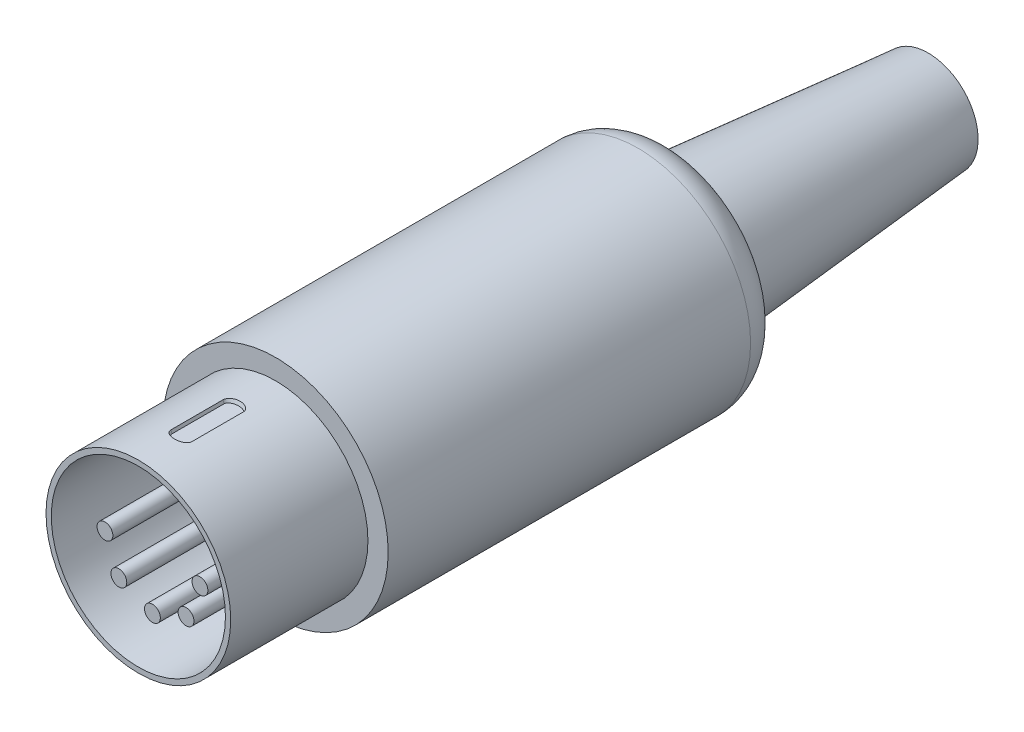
ISO-10303-21;
HEADER;
FILE_DESCRIPTION(('STEP AP214'),'2;1');
FILE_NAME('part.step','',(''),(''),'','','');
FILE_SCHEMA(('AUTOMOTIVE_DESIGN { 1 0 10303 214 1 1 1 1 }'));
ENDSEC;
DATA;
#1=APPLICATION_CONTEXT('core data for automotive mechanical design processes');
#2=APPLICATION_PROTOCOL_DEFINITION('international standard','automotive_design',2000,#1);
#3=PRODUCT_CONTEXT('',#1,'mechanical');
#4=PRODUCT('Part','Part','',(#3));
#5=PRODUCT_RELATED_PRODUCT_CATEGORY('part','',(#4));
#6=PRODUCT_DEFINITION_FORMATION('','',#4);
#7=PRODUCT_DEFINITION_CONTEXT('part definition',#1,'design');
#8=PRODUCT_DEFINITION('design','',#6,#7);
#9=PRODUCT_DEFINITION_SHAPE('','',#8);
#10=(LENGTH_UNIT() NAMED_UNIT(*) SI_UNIT(.MILLI.,.METRE.));
#11=(NAMED_UNIT(*) PLANE_ANGLE_UNIT() SI_UNIT($,.RADIAN.));
#12=(NAMED_UNIT(*) SI_UNIT($,.STERADIAN.) SOLID_ANGLE_UNIT());
#13=UNCERTAINTY_MEASURE_WITH_UNIT(LENGTH_MEASURE(1.E-05),#10,'distance_accuracy_value','');
#14=(GEOMETRIC_REPRESENTATION_CONTEXT(3) GLOBAL_UNCERTAINTY_ASSIGNED_CONTEXT((#13)) GLOBAL_UNIT_ASSIGNED_CONTEXT((#10,
#11,#12)) REPRESENTATION_CONTEXT('',''));
#15=CARTESIAN_POINT('',(0.,0.,0.));
#16=DIRECTION('',(0.,0.,1.));
#17=DIRECTION('',(1.,0.,0.));
#18=AXIS2_PLACEMENT_3D('',#15,#16,#17);
#19=CARTESIAN_POINT('',(0.,0.,10.9210928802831));
#20=DIRECTION('',(0.,0.,1.));
#21=DIRECTION('',(1.,0.,0.));
#22=AXIS2_PLACEMENT_3D('',#19,#20,#21);
#23=CYLINDRICAL_SURFACE('',#22,6.2865);
#24=CARTESIAN_POINT('',(0.,0.,28.702));
#25=DIRECTION('',(0.,0.,1.));
#26=DIRECTION('',(1.,0.,0.));
#27=AXIS2_PLACEMENT_3D('',#24,#25,#26);
#28=CIRCLE('',#27,6.2865);
#29=CARTESIAN_POINT('',(6.2865,0.,28.702));
#30=VERTEX_POINT('',#29);
#31=EDGE_CURVE('E270',#30,#30,#28,.F.);
#32=ORIENTED_EDGE('',*,*,#31,.T.);
#33=EDGE_LOOP('',(#32));
#34=FACE_BOUND('',#33,.T.);
#35=CARTESIAN_POINT('',(0.,0.,38.608));
#36=DIRECTION('',(0.,0.,1.));
#37=DIRECTION('',(1.,0.,0.));
#38=AXIS2_PLACEMENT_3D('',#35,#36,#37);
#39=CIRCLE('',#38,6.2865);
#40=CARTESIAN_POINT('',(6.2865,0.,38.608));
#41=VERTEX_POINT('',#40);
#42=EDGE_CURVE('E274',#41,#41,#39,.T.);
#43=ORIENTED_EDGE('',*,*,#42,.T.);
#44=EDGE_LOOP('',(#43));
#45=FACE_BOUND('',#44,.T.);
#46=CARTESIAN_POINT('',(-1.33423254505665,6.14328135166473,36.2002500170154));
#47=CARTESIAN_POINT('',(-1.03705257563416,6.20782457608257,36.3069327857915));
#48=CARTESIAN_POINT('',(-0.920316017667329,5.90795370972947,36.3246250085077));
#49=CARTESIAN_POINT('',(-1.34882280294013,6.14009830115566,36.2401325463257));
#50=CARTESIAN_POINT('',(-1.04568286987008,6.20668706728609,36.3297987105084));
#51=CARTESIAN_POINT('',(-0.927384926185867,5.90698476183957,36.3445662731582));
#52=CARTESIAN_POINT('',(-1.35983127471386,6.13766654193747,36.2812088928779));
#53=CARTESIAN_POINT('',(-1.05216609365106,6.20583064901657,36.3532721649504));
#54=CARTESIAN_POINT('',(-0.932712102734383,5.90622592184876,36.3651044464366));
#55=CARTESIAN_POINT('',(-1.37454585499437,6.13439565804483,36.3645238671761));
#56=CARTESIAN_POINT('',(-1.06081603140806,6.20468670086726,36.4008344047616));
#57=CARTESIAN_POINT('',(-0.939828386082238,5.90519274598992,36.4067619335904));
#58=CARTESIAN_POINT('',(-1.37825752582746,6.13355532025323,36.4067615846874));
#59=CARTESIAN_POINT('',(-1.06298293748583,6.20439914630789,36.4249152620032));
#60=CARTESIAN_POINT('',(-0.941620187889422,5.90491804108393,36.4278807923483));
#61=CARTESIAN_POINT('',(-1.37826236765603,6.13355220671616,36.4912360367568));
#62=CARTESIAN_POINT('',(-1.06298390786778,6.20439883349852,36.4730834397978));
#63=CARTESIAN_POINT('',(-0.941622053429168,5.90491575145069,36.4701180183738));
#64=CARTESIAN_POINT('',(-1.37455595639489,6.13438933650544,36.5334727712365));
#65=CARTESIAN_POINT('',(-1.0608182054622,6.20468604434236,36.4971597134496));
#66=CARTESIAN_POINT('',(-0.939832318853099,5.90518813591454,36.491236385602));
#67=CARTESIAN_POINT('',(-1.35983022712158,6.13767084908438,36.6167432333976));
#68=CARTESIAN_POINT('',(-1.05216928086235,6.20583059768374,36.5447042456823));
#69=CARTESIAN_POINT('',(-0.932712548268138,5.90622989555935,36.5328716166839));
#70=CARTESIAN_POINT('',(-1.34881184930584,6.14011502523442,36.6577771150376));
#71=CARTESIAN_POINT('',(-1.0456898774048,6.20668743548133,36.5681644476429));
#72=CARTESIAN_POINT('',(-0.927382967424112,5.90699920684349,36.553388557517));
#73=CARTESIAN_POINT('',(-1.31973927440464,6.14642899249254,36.7374870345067));
#74=CARTESIAN_POINT('',(-1.02847152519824,6.20895431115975,36.6138208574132));
#75=CARTESIAN_POINT('',(-0.913290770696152,5.90890257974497,36.5932435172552));
#76=CARTESIAN_POINT('',(-1.30168420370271,6.15029896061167,36.7761627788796));
#77=CARTESIAN_POINT('',(-1.01773529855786,6.21036399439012,36.6360160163));
#78=CARTESIAN_POINT('',(-0.904527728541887,5.9100366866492,36.6125813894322));
#79=CARTESIAN_POINT('',(-1.25901144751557,6.15917571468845,36.8500489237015));
#80=CARTESIAN_POINT('',(-0.992146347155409,6.21369499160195,36.6784120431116));
#81=CARTESIAN_POINT('',(-0.883747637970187,5.91245022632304,36.6495244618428));
#82=CARTESIAN_POINT('',(-1.23439380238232,6.16418249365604,36.8852593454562));
#83=CARTESIAN_POINT('',(-0.977290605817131,6.21561670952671,36.6986220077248));
#84=CARTESIAN_POINT('',(-0.871730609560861,5.91372965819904,36.6671296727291));
#85=CARTESIAN_POINT('',(-1.17930225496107,6.17495849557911,36.9511707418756));
#86=CARTESIAN_POINT('',(-0.94375841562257,6.21989215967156,36.7362323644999));
#87=CARTESIAN_POINT('',(-0.844703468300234,5.91613267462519,36.7000853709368));
#88=CARTESIAN_POINT('',(-1.14883692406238,6.18072659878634,36.981878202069));
#89=CARTESIAN_POINT('',(-0.925069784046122,6.22224751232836,36.7536550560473));
#90=CARTESIAN_POINT('',(-0.829697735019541,5.91725648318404,36.7154391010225));
#91=CARTESIAN_POINT('',(-1.08285978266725,6.19262617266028,37.0380262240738));
#92=CARTESIAN_POINT('',(-0.884278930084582,6.22727936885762,36.7849262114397));
#93=CARTESIAN_POINT('',(-0.79695705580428,5.9189782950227,36.74351311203));
#94=CARTESIAN_POINT('',(-1.04734485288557,6.1987578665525,37.0634635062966));
#95=CARTESIAN_POINT('',(-0.862132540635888,6.2299610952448,36.7987945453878));
#96=CARTESIAN_POINT('',(-0.779220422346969,5.91957597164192,36.7562317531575));
#97=CARTESIAN_POINT('',(-0.972051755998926,6.21101112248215,37.1085786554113));
#98=CARTESIAN_POINT('',(-0.814876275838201,6.23551923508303,36.8222356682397));
#99=CARTESIAN_POINT('',(-0.741188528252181,5.91980153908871,36.7787893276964));
#100=CARTESIAN_POINT('',(-0.932246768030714,6.21713234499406,37.1282170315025));
#101=CARTESIAN_POINT('',(-0.789671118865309,6.23840521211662,36.831794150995));
#102=CARTESIAN_POINT('',(-0.720877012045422,5.9194229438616,36.7886085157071));
#103=CARTESIAN_POINT('',(-0.849836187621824,6.22893166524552,37.1611380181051));
#104=CARTESIAN_POINT('',(-0.737217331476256,6.24419235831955,36.8457440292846));
#105=CARTESIAN_POINT('',(-0.678064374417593,5.91716739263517,36.8050690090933));
#106=CARTESIAN_POINT('',(-0.807237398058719,6.23461077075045,37.1744354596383));
#107=CARTESIAN_POINT('',(-0.709853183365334,6.24710521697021,36.8501374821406));
#108=CARTESIAN_POINT('',(-0.655568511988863,5.9152939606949,36.8117177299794));
#109=CARTESIAN_POINT('',(-0.718458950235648,6.24547668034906,37.1952279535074));
#110=CARTESIAN_POINT('',(-0.652520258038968,6.25294115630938,36.8532415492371));
#111=CARTESIAN_POINT('',(-0.607338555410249,5.90935219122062,36.8221139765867));
#112=CARTESIAN_POINT('',(-0.672204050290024,6.25063227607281,37.2024521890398));
#113=CARTESIAN_POINT('',(-0.622314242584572,6.2558738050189,36.8516318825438));
#114=CARTESIAN_POINT('',(-0.581507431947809,5.90519389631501,36.8257260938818));
#115=CARTESIAN_POINT('',(-0.602189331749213,6.25763619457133,37.2086866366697));
#116=CARTESIAN_POINT('',(-0.576339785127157,6.260092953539,36.8441056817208));
#117=CARTESIAN_POINT('',(-0.540437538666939,5.89676782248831,36.8288433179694));
#118=CARTESIAN_POINT('',(-0.578659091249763,6.25985597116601,37.2099940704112));
#119=CARTESIAN_POINT('',(-0.560680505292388,6.26148811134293,36.8406716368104));
#120=CARTESIAN_POINT('',(-0.526304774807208,5.89357874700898,36.829497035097));
#121=CARTESIAN_POINT('',(-0.531544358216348,6.26403229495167,37.2112057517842));
#122=CARTESIAN_POINT('',(-0.528987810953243,6.26422004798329,36.8319781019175));
#123=CARTESIAN_POINT('',(-0.497097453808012,5.88640864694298,36.8301028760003));
#124=CARTESIAN_POINT('',(-0.507959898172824,6.26598897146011,37.2111106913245));
#125=CARTESIAN_POINT('',(-0.512912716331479,6.2655593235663,36.8266863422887));
#126=CARTESIAN_POINT('',(-0.482023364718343,5.88242801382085,36.8300553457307));
#127=CARTESIAN_POINT('',(-0.444816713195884,6.27086882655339,37.2092207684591));
#128=CARTESIAN_POINT('',(-0.468912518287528,6.26908698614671,36.8098361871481));
#129=CARTESIAN_POINT('',(-0.440047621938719,5.87063685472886,36.8291103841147));
#130=CARTESIAN_POINT('',(-0.405279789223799,6.27354668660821,37.2063160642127));
#131=CARTESIAN_POINT('',(-0.440532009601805,6.27121400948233,36.7964274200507));
#132=CARTESIAN_POINT('',(-0.412062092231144,5.86206056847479,36.8276580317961));
#133=CARTESIAN_POINT('',(-0.34611988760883,6.27699570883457,37.2003808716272));
#134=CARTESIAN_POINT('',(-0.395523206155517,6.27425825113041,36.7725199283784));
#135=CARTESIAN_POINT('',(-0.366127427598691,5.84774592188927,36.8246904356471));
#136=CARTESIAN_POINT('',(-0.326407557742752,6.27805140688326,37.1981368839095));
#137=CARTESIAN_POINT('',(-0.379844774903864,6.27526401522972,36.763752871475));
#138=CARTESIAN_POINT('',(-0.350141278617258,5.84272781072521,36.8235684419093));
#139=CARTESIAN_POINT('',(-0.287010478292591,6.27997579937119,37.1933588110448));
#140=CARTESIAN_POINT('',(-0.346896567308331,6.27723111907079,36.7450382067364));
#141=CARTESIAN_POINT('',(-0.316533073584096,5.8324140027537,36.8211794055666));
#142=CARTESIAN_POINT('',(-0.267325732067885,6.28084447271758,37.1908246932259));
#143=CARTESIAN_POINT('',(-0.329575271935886,6.27819281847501,36.7350559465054));
#144=CARTESIAN_POINT('',(-0.298910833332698,5.82711827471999,36.8199123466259));
#145=CARTESIAN_POINT('',(-0.22834457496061,6.28238123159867,37.1857912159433));
#146=CARTESIAN_POINT('',(-0.292935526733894,6.28003246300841,36.7146009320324));
#147=CARTESIAN_POINT('',(-0.262121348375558,5.81669307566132,36.817395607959));
#148=CARTESIAN_POINT('',(-0.209048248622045,6.28305297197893,37.1832921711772));
#149=CARTESIAN_POINT('',(-0.273607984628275,6.28091088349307,36.7041230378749));
#150=CARTESIAN_POINT('',(-0.242991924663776,5.81156239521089,36.8161460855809));
#151=CARTESIAN_POINT('',(-0.170416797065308,6.28421941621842,37.1785770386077));
#152=CARTESIAN_POINT('',(-0.231880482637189,6.28256007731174,36.6834622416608));
#153=CARTESIAN_POINT('',(-0.202760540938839,5.80184924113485,36.8137885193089));
#154=CARTESIAN_POINT('',(-0.151081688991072,6.28471418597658,37.1763608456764));
#155=CARTESIAN_POINT('',(-0.209458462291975,6.28332723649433,36.6733039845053));
#156=CARTESIAN_POINT('',(-0.181659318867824,5.79726656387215,36.812680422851));
#157=CARTESIAN_POINT('',(-0.112368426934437,6.28552539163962,37.1725327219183));
#158=CARTESIAN_POINT('',(-0.161084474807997,6.28467064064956,36.6549792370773));
#159=CARTESIAN_POINT('',(-0.137630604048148,5.789296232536,36.8107663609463));
#160=CARTESIAN_POINT('',(-0.0929904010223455,6.28584212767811,37.1709197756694));
#161=CARTESIAN_POINT('',(-0.135192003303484,6.28524079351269,36.6468864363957));
#162=CARTESIAN_POINT('',(-0.114706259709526,5.78590657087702,36.8099598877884));
#163=CARTESIAN_POINT('',(-0.0541486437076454,6.28629687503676,37.1685306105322));
#164=CARTESIAN_POINT('',(-0.0805631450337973,6.28609635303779,36.6345495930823));
#165=CARTESIAN_POINT('',(-0.0676233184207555,5.78086382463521,36.8087653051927));
#166=CARTESIAN_POINT('',(-0.0346848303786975,6.28643463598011,37.1677555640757));
#167=CARTESIAN_POINT('',(-0.0519989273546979,6.28637491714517,36.6304009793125));
#168=CARTESIAN_POINT('',(-0.0434630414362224,5.77921317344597,36.8083777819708));
#169=CARTESIAN_POINT('',(-0.0152001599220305,6.28648162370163,37.1675210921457));
#170=CARTESIAN_POINT('',(-0.0227787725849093,6.28646329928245,36.6291457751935));
#171=CARTESIAN_POINT('',(-0.019029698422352,5.77871408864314,36.8082605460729));
#172=(BOUNDED_SURFACE() B_SPLINE_SURFACE(3,2,((#46,#47,#48),(#49,#50,#51),(#52,#53,#54),(#55,
#56,#57),(#58,#59,#60),(#61,#62,#63),(#64,#65,#66),(#67,#68,#69),(#70,#71,#72),(#73,#74,#75),
(#76,#77,#78),(#79,#80,#81),(#82,#83,#84),(#85,#86,#87),(#88,#89,#90),(#91,#92,#93),(#94,#95,
#96),(#97,#98,#99),(#100,#101,#102),(#103,#104,#105),(#106,#107,#108),(#109,#110,#111),(#112,
#113,#114),(#115,#116,#117),(#118,#119,#120),(#121,#122,#123),(#124,#125,#126),(#127,#128,#129),
(#130,#131,#132),(#133,#134,#135),(#136,#137,#138),(#139,#140,#141),(#142,#143,#144),(#145,#146,
#147),(#148,#149,#150),(#151,#152,#153),(#154,#155,#156),(#157,#158,#159),(#160,#161,#162),
(#163,#164,#165),(#166,#167,#168),(#169,#170,#171)),.UNSPECIFIED.,.F.,.F.,
.F.) B_SPLINE_SURFACE_WITH_KNOTS((4,2,2,2,2,2,2,2,2,2,2,2,2,2,2,2,2,2,2,2,4),(3,3),(0.,
0.126663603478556,0.253230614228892,0.379790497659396,0.506334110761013,0.632893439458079,
0.759451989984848,0.88582643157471,1.0122792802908,1.13957440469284,1.26657031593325,
1.39896715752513,1.46565164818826,1.53230324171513,1.64419018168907,1.70022852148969,
1.75627317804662,1.81120013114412,1.86610660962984,1.92092024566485,1.97581048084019),(0.,1.),
.UNSPECIFIED.) GEOMETRIC_REPRESENTATION_ITEM() RATIONAL_B_SPLINE_SURFACE(((1.,0.763491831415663,
1.),(1.,0.763243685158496,1.),(1.,0.763031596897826,1.),(1.,0.762731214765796,1.),(1.,
0.762642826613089,1.),(1.,0.762640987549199,1.),(1.,0.762727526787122,1.),(1.,0.763035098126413,
1.),(1.,0.763256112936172,1.),(1.,0.763726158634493,1.),(1.,0.763975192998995,1.),(1.,
0.764325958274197,1.),(1.,0.764427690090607,1.),(1.,0.764246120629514,1.),(1.,0.763963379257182,
1.),(1.,0.762716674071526,1.),(1.,0.761752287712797,1.),(1.,0.758771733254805,1.),(1.,
0.756748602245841,1.),(1.,0.751212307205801,1.),(1.,0.747702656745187,1.),(1.,0.738466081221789,
1.),(1.,0.732651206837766,1.),(1.,0.721730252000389,1.),(1.,0.717704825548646,1.),(1.,
0.708834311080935,1.),(1.,0.703989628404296,1.),(1.,0.689795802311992,1.),(1.,0.679621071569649,
1.),(1.,0.662593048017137,1.),(1.,0.656616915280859,1.),(1.,0.644265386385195,1.),(1.,
0.637889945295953,1.),(1.,0.625232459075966,1.),(1.,0.618951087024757,1.),(1.,0.606944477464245,
1.),(1.,0.601219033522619,1.),(1.,0.591177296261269,1.),(1.,0.586858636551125,1.),(1.,
0.580402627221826,1.),(1.,0.578268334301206,1.),(1.,0.57762661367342,1.))) REPRESENTATION_ITEM('') SURFACE());
#173=CARTESIAN_POINT('',(-0.0152001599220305,6.28648162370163,37.1675210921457));
#174=CARTESIAN_POINT('',(-0.0346848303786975,6.28643463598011,37.1677555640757));
#175=CARTESIAN_POINT('',(-0.0541486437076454,6.28629687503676,37.1685306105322));
#176=CARTESIAN_POINT('',(-0.0929904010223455,6.28584212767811,37.1709197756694));
#177=CARTESIAN_POINT('',(-0.112368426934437,6.28552539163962,37.1725327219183));
#178=CARTESIAN_POINT('',(-0.151081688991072,6.28471418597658,37.1763608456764));
#179=CARTESIAN_POINT('',(-0.170416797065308,6.28421941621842,37.1785770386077));
#180=CARTESIAN_POINT('',(-0.209048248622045,6.28305297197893,37.1832921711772));
#181=CARTESIAN_POINT('',(-0.22834457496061,6.28238123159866,37.1857912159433));
#182=CARTESIAN_POINT('',(-0.267325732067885,6.28084447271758,37.1908246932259));
#183=CARTESIAN_POINT('',(-0.287010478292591,6.27997579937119,37.1933588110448));
#184=CARTESIAN_POINT('',(-0.326407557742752,6.27805140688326,37.1981368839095));
#185=CARTESIAN_POINT('',(-0.34611988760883,6.27699570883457,37.2003808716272));
#186=CARTESIAN_POINT('',(-0.405279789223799,6.27354668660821,37.2063160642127));
#187=CARTESIAN_POINT('',(-0.444816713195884,6.27086882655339,37.2092207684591));
#188=CARTESIAN_POINT('',(-0.507959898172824,6.26598897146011,37.2111106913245));
#189=CARTESIAN_POINT('',(-0.531544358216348,6.26403229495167,37.2112057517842));
#190=CARTESIAN_POINT('',(-0.578659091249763,6.25985597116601,37.2099940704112));
#191=CARTESIAN_POINT('',(-0.602189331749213,6.25763619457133,37.2086866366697));
#192=CARTESIAN_POINT('',(-0.672204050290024,6.25063227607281,37.2024521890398));
#193=CARTESIAN_POINT('',(-0.718458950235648,6.24547668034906,37.1952279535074));
#194=CARTESIAN_POINT('',(-0.807237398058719,6.23461077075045,37.1744354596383));
#195=CARTESIAN_POINT('',(-0.849836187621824,6.22893166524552,37.1611380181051));
#196=CARTESIAN_POINT('',(-0.932246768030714,6.21713234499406,37.1282170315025));
#197=CARTESIAN_POINT('',(-0.972051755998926,6.21101112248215,37.1085786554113));
#198=CARTESIAN_POINT('',(-1.04734485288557,6.1987578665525,37.0634635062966));
#199=CARTESIAN_POINT('',(-1.08285978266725,6.19262617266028,37.0380262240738));
#200=CARTESIAN_POINT('',(-1.14883692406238,6.18072659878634,36.981878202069));
#201=CARTESIAN_POINT('',(-1.17930225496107,6.17495849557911,36.9511707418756));
#202=CARTESIAN_POINT('',(-1.23439380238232,6.16418249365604,36.8852593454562));
#203=CARTESIAN_POINT('',(-1.25901144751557,6.15917571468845,36.8500489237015));
#204=CARTESIAN_POINT('',(-1.30168420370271,6.15029896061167,36.7761627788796));
#205=CARTESIAN_POINT('',(-1.31973927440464,6.14642899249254,36.7374870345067));
#206=CARTESIAN_POINT('',(-1.34881184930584,6.14011502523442,36.6577771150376));
#207=CARTESIAN_POINT('',(-1.35983022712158,6.13767084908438,36.6167432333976));
#208=CARTESIAN_POINT('',(-1.37455595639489,6.13438933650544,36.5334727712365));
#209=CARTESIAN_POINT('',(-1.37826236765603,6.13355220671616,36.4912360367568));
#210=CARTESIAN_POINT('',(-1.37825752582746,6.13355532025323,36.4067615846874));
#211=CARTESIAN_POINT('',(-1.37454585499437,6.13439565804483,36.3645238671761));
#212=CARTESIAN_POINT('',(-1.35983127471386,6.13766654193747,36.2812088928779));
#213=CARTESIAN_POINT('',(-1.34882280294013,6.14009830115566,36.2401325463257));
#214=CARTESIAN_POINT('',(-1.33423254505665,6.14328135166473,36.2002500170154));
#215=B_SPLINE_CURVE_WITH_KNOTS('',3,(#173,#174,#175,#176,#177,#178,#179,#180,#181,#182,#183,
#184,#185,#186,#187,#188,#189,#190,#191,#192,#193,#194,#195,#196,#197,#198,#199,#200,#201,#202,
#203,#204,#205,#206,#207,#208,#209,#210,#211,#212,#213,#214),.UNSPECIFIED.,.F.,.F.,(4,2,2,2,2,2,
2,2,2,2,2,2,2,2,2,2,2,2,2,2,4),(0.,0.0548902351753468,0.109703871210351,0.164610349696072,
0.219537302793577,0.275581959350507,0.331620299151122,0.44350723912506,0.510158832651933,
0.57684332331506,0.709240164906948,0.836236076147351,0.963531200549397,1.08998404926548,
1.21635849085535,1.34291704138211,1.46947637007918,1.5960199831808,1.7225798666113,
1.84914687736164,1.97581048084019),.UNSPECIFIED.);
#216=CARTESIAN_POINT('',(-0.52367536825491,6.26465053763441,37.211));
#217=VERTEX_POINT('',#216);
#218=CARTESIAN_POINT('',(-1.37825994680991,6.13355376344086,36.449));
#219=VERTEX_POINT('',#218);
#220=EDGE_CURVE('E276',#217,#219,#215,.T.);
#221=ORIENTED_EDGE('',*,*,#220,.F.);
#222=CARTESIAN_POINT('',(0.,0.,37.211));
#223=DIRECTION('',(0.,0.,1.));
#224=DIRECTION('',(1.,0.,0.));
#225=AXIS2_PLACEMENT_3D('',#222,#223,#224);
#226=CIRCLE('',#225,6.2865);
#227=CARTESIAN_POINT('',(0.52367536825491,6.26465053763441,37.211));
#228=VERTEX_POINT('',#227);
#229=EDGE_CURVE('E279',#217,#228,#226,.F.);
#230=ORIENTED_EDGE('',*,*,#229,.T.);
#231=CARTESIAN_POINT('',(0.259377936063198,6.28114681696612,37.1897967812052));
#232=CARTESIAN_POINT('',(0.32214779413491,6.27855475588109,36.7309455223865));
#233=CARTESIAN_POINT('',(0.291297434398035,5.82499594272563,36.8193983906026));
#234=CARTESIAN_POINT('',(0.281178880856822,6.28024630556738,37.1926158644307));
#235=CARTESIAN_POINT('',(0.341858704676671,6.27752077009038,36.7421607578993));
#236=CARTESIAN_POINT('',(0.311463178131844,5.83087289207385,36.8208079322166));
#237=CARTESIAN_POINT('',(0.302991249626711,6.27923208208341,37.1953676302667));
#238=CARTESIAN_POINT('',(0.360531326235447,6.27644283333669,36.7528828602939));
#239=CARTESIAN_POINT('',(0.330484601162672,5.83667171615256,36.8221838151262));
#240=CARTESIAN_POINT('',(0.346681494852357,6.27697173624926,37.200434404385));
#241=CARTESIAN_POINT('',(0.396028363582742,6.2742343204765,36.7727494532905));
#242=CARTESIAN_POINT('',(0.366658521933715,5.84787349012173,36.82471720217));
#243=CARTESIAN_POINT('',(0.3685594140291,6.2757253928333,37.2027489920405));
#244=CARTESIAN_POINT('',(0.412917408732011,6.27310291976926,36.7819404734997));
#245=CARTESIAN_POINT('',(0.383809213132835,5.85327605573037,36.8258744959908));
#246=CARTESIAN_POINT('',(0.412627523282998,6.27298274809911,37.2066545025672));
#247=CARTESIAN_POINT('',(0.445773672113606,6.27078287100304,36.7986081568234));
#248=CARTESIAN_POINT('',(0.416808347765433,5.86349046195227,36.8278272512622));
#249=CARTESIAN_POINT('',(0.434818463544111,6.27148379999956,37.208237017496));
#250=CARTESIAN_POINT('',(0.461789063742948,6.2695916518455,36.8061177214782));
#251=CARTESIAN_POINT('',(0.432640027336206,5.86829499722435,36.8286185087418));
#252=CARTESIAN_POINT('',(0.479229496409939,6.26824687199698,37.2104116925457));
#253=CARTESIAN_POINT('',(0.493103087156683,6.26716292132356,36.8193355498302));
#254=CARTESIAN_POINT('',(0.463109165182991,5.8771794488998,36.8297058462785));
#255=CARTESIAN_POINT('',(0.501449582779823,6.26650893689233,37.2110040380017));
#256=CARTESIAN_POINT('',(0.508448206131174,6.2659233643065,36.8250863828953));
#257=CARTESIAN_POINT('',(0.477746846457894,5.88125950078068,36.8300020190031));
#258=CARTESIAN_POINT('',(0.581060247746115,6.25985232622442,37.2109895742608));
#259=CARTESIAN_POINT('',(0.562102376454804,6.26143845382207,36.8423999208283));
#260=CARTESIAN_POINT('',(0.52857630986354,5.89456716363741,36.8299947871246));
#261=CARTESIAN_POINT('',(0.638483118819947,6.2542510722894,37.2070035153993));
#262=CARTESIAN_POINT('',(0.60017935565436,6.2579800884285,36.8495813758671));
#263=CARTESIAN_POINT('',(0.562234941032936,5.90172770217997,36.8280017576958));
#264=CARTESIAN_POINT('',(0.751207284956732,6.24171186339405,37.1891795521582));
#265=CARTESIAN_POINT('',(0.673616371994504,6.25086132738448,36.8536202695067));
#266=CARTESIAN_POINT('',(0.625551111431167,5.91211787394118,36.8190897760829));
#267=CARTESIAN_POINT('',(0.806517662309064,6.23478065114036,37.1753904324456));
#268=CARTESIAN_POINT('',(0.709406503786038,6.24717044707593,36.8507463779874));
#269=CARTESIAN_POINT('',(0.655227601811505,5.91536675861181,36.8121952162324));
#270=CARTESIAN_POINT('',(0.909765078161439,6.22052793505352,37.1387130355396));
#271=CARTESIAN_POINT('',(0.775375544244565,6.24002744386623,36.8367757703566));
#272=CARTESIAN_POINT('',(0.7093651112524,5.91911607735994,36.7938565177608));
#273=CARTESIAN_POINT('',(0.957945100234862,6.21325431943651,37.1164161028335));
#274=CARTESIAN_POINT('',(0.805975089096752,6.23655448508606,36.8262204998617));
#275=CARTESIAN_POINT('',(0.734031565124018,5.91976879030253,36.7827080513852));
#276=CARTESIAN_POINT('',(1.04868213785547,6.19858583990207,37.063195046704));
#277=CARTESIAN_POINT('',(0.862969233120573,6.22987281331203,36.798750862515));
#278=CARTESIAN_POINT('',(0.779922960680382,5.91963707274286,36.7560975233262));
#279=CARTESIAN_POINT('',(1.09123106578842,6.19119081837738,37.0322587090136));
#280=CARTESIAN_POINT('',(0.889493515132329,6.22664968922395,36.781803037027));
#281=CARTESIAN_POINT('',(0.801142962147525,5.91885059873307,36.7406293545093));
#282=CARTESIAN_POINT('',(1.16314389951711,6.17805141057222,36.9679885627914));
#283=CARTESIAN_POINT('',(0.933862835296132,6.22114550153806,36.7458094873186));
#284=CARTESIAN_POINT('',(0.836757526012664,5.91676804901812,36.7084942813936));
#285=CARTESIAN_POINT('',(1.19352604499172,6.1722237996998,36.9356672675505));
#286=CARTESIAN_POINT('',(0.952450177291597,6.21879076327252,36.7274112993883));
#287=CARTESIAN_POINT('',(0.85169644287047,5.91556333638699,36.6923336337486));
#288=CARTESIAN_POINT('',(1.24795500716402,6.16144958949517,36.866508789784));
#289=CARTESIAN_POINT('',(0.985490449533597,6.21455960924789,36.6878747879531));
#290=CARTESIAN_POINT('',(0.878358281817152,5.9130517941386,36.6577543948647));
#291=CARTESIAN_POINT('',(1.27200387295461,6.15650270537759,36.8296730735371));
#292=CARTESIAN_POINT('',(0.999960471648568,6.21268102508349,36.6667190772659));
#293=CARTESIAN_POINT('',(0.890082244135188,5.91174499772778,36.6393365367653));
#294=CARTESIAN_POINT('',(1.31257872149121,6.14797866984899,36.753539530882));
#295=CARTESIAN_POINT('',(1.02422634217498,6.20951319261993,36.6230337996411));
#296=CARTESIAN_POINT('',(0.909818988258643,5.90936678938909,36.6012697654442));
#297=CARTESIAN_POINT('',(1.32927609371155,6.14437066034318,36.7143251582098));
#298=CARTESIAN_POINT('',(1.03413032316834,6.20821032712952,36.6005437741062));
#299=CARTESIAN_POINT('',(0.91791640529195,5.9082903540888,36.5816625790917));
#300=CARTESIAN_POINT('',(1.35557926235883,6.13862086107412,36.6337423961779));
#301=CARTESIAN_POINT('',(1.04967650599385,6.20616069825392,36.5544175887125));
#302=CARTESIAN_POINT('',(0.930657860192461,5.90653319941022,36.5413711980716));
#303=CARTESIAN_POINT('',(1.36518232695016,6.13647963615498,36.5923731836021));
#304=CARTESIAN_POINT('',(1.05531342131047,6.20541462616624,36.530783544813));
#305=CARTESIAN_POINT('',(0.935300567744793,5.90585263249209,36.5206865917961));
#306=CARTESIAN_POINT('',(1.37702661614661,6.13383491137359,36.5086973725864));
#307=CARTESIAN_POINT('',(1.06226571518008,6.20449428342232,36.4830287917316));
#308=CARTESIAN_POINT('',(0.941026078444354,5.90500984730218,36.4788486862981));
#309=CARTESIAN_POINT('',(1.37927234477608,6.13333040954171,36.4663913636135));
#310=CARTESIAN_POINT('',(1.06358093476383,6.20432003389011,36.4589176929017));
#311=CARTESIAN_POINT('',(0.942111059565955,5.90484731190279,36.4576956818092));
#312=CARTESIAN_POINT('',(1.37639696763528,6.13396821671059,36.3819899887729));
#313=CARTESIAN_POINT('',(1.06188781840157,6.20454394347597,36.4107926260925));
#314=CARTESIAN_POINT('',(0.940720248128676,5.90504806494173,36.415494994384));
#315=CARTESIAN_POINT('',(1.37127178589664,6.13511143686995,36.339894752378));
#316=CARTESIAN_POINT('',(1.05887776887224,6.20494232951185,36.3867886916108));
#317=CARTESIAN_POINT('',(0.938242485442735,5.90541164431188,36.394447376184));
#318=CARTESIAN_POINT('',(1.36245107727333,6.13708475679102,36.2985155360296));
#319=CARTESIAN_POINT('',(1.05370600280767,6.20562708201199,36.3631414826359));
#320=CARTESIAN_POINT('',(0.93397925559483,5.90604256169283,36.3737577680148));
#321=(BOUNDED_SURFACE() B_SPLINE_SURFACE(3,2,((#231,#232,#233),(#234,#235,#236),(#237,#238,
#239),(#240,#241,#242),(#243,#244,#245),(#246,#247,#248),(#249,#250,#251),(#252,#253,#254),
(#255,#256,#257),(#258,#259,#260),(#261,#262,#263),(#264,#265,#266),(#267,#268,#269),(#270,#271,
#272),(#273,#274,#275),(#276,#277,#278),(#279,#280,#281),(#282,#283,#284),(#285,#286,#287),
(#288,#289,#290),(#291,#292,#293),(#294,#295,#296),(#297,#298,#299),(#300,#301,#302),(#303,#304,
#305),(#306,#307,#308),(#309,#310,#311),(#312,#313,#314),(#315,#316,#317),(#318,#319,#320)),
.UNSPECIFIED.,.F.,.F.,.F.) B_SPLINE_SURFACE_WITH_KNOTS((4,2,2,2,2,2,2,2,2,2,2,2,2,2,4),(3,3),
(0.,0.0620790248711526,0.124217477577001,0.18705288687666,0.249876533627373,0.412081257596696,
0.573484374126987,0.725267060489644,0.877265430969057,1.00703159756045,1.13675572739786,
1.26327062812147,1.38983422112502,1.51632031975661,1.64287638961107),(0.,1.),
.UNSPECIFIED.) GEOMETRIC_REPRESENTATION_ITEM() RATIONAL_B_SPLINE_SURFACE(((1.,0.635306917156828,
1.),(1.,0.642420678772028,1.),(1.,0.649375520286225,1.),(1.,0.662751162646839,1.),(1.,
0.669171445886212,1.),(1.,0.681315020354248,1.),(1.,0.68702968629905,1.),(1.,0.697658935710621,
1.),(1.,0.702573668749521,1.),(1.,0.718810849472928,1.),(1.,0.72797094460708,1.),(1.,
0.742424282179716,1.),(1.,0.747736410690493,1.),(1.,0.755521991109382,1.),(1.,0.758145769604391,
1.),(1.,0.761863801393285,1.),(1.,0.762955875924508,1.),(1.,0.764131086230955,1.),(1.,
0.764338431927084,1.),(1.,0.764395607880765,1.),(1.,0.764245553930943,1.),(1.,0.763837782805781,
1.),(1.,0.763582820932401,1.),(1.,0.763126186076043,1.),(1.,0.762924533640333,1.),(1.,
0.762672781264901,1.),(1.,0.762622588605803,1.),(1.,0.762680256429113,1.),(1.,0.762788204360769,
1.),(1.,0.762978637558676,1.))) REPRESENTATION_ITEM('') SURFACE());
#322=CARTESIAN_POINT('',(1.36245107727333,6.13708475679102,36.2985155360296));
#323=CARTESIAN_POINT('',(1.37127178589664,6.13511143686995,36.339894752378));
#324=CARTESIAN_POINT('',(1.37639696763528,6.13396821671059,36.3819899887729));
#325=CARTESIAN_POINT('',(1.37927234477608,6.13333040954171,36.4663913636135));
#326=CARTESIAN_POINT('',(1.37702661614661,6.13383491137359,36.5086973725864));
#327=CARTESIAN_POINT('',(1.36518232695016,6.13647963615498,36.5923731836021));
#328=CARTESIAN_POINT('',(1.35557926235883,6.13862086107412,36.6337423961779));
#329=CARTESIAN_POINT('',(1.32927609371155,6.14437066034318,36.7143251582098));
#330=CARTESIAN_POINT('',(1.31257872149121,6.14797866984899,36.753539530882));
#331=CARTESIAN_POINT('',(1.27200387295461,6.15650270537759,36.8296730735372));
#332=CARTESIAN_POINT('',(1.24795500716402,6.16144958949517,36.866508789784));
#333=CARTESIAN_POINT('',(1.19352604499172,6.1722237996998,36.9356672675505));
#334=CARTESIAN_POINT('',(1.16314389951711,6.17805141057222,36.9679885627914));
#335=CARTESIAN_POINT('',(1.09123106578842,6.19119081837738,37.0322587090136));
#336=CARTESIAN_POINT('',(1.04868213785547,6.19858583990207,37.063195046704));
#337=CARTESIAN_POINT('',(0.957945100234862,6.21325431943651,37.1164161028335));
#338=CARTESIAN_POINT('',(0.909765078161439,6.22052793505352,37.1387130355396));
#339=CARTESIAN_POINT('',(0.806517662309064,6.23478065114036,37.1753904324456));
#340=CARTESIAN_POINT('',(0.751207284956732,6.24171186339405,37.1891795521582));
#341=CARTESIAN_POINT('',(0.638483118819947,6.2542510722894,37.2070035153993));
#342=CARTESIAN_POINT('',(0.581060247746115,6.25985232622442,37.2109895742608));
#343=CARTESIAN_POINT('',(0.501449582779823,6.26650893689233,37.2110040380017));
#344=CARTESIAN_POINT('',(0.479229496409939,6.26824687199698,37.2104116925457));
#345=CARTESIAN_POINT('',(0.434818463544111,6.27148379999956,37.208237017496));
#346=CARTESIAN_POINT('',(0.412627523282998,6.27298274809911,37.2066545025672));
#347=CARTESIAN_POINT('',(0.368559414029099,6.2757253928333,37.2027489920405));
#348=CARTESIAN_POINT('',(0.346681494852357,6.27697173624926,37.200434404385));
#349=CARTESIAN_POINT('',(0.302991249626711,6.27923208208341,37.1953676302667));
#350=CARTESIAN_POINT('',(0.281178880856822,6.28024630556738,37.1926158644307));
#351=CARTESIAN_POINT('',(0.259377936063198,6.28114681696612,37.1897967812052));
#352=B_SPLINE_CURVE_WITH_KNOTS('',3,(#322,#323,#324,#325,#326,#327,#328,#329,#330,#331,#332,
#333,#334,#335,#336,#337,#338,#339,#340,#341,#342,#343,#344,#345,#346,#347,#348,#349,#350,#351),
.UNSPECIFIED.,.F.,.F.,(4,2,2,2,2,2,2,2,2,2,2,2,2,2,4),(0.,0.126556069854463,0.25304216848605,
0.379605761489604,0.506120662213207,0.635844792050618,0.765610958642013,0.917609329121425,
1.06939201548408,1.23079513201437,1.3929998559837,1.45582350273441,1.51865891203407,
1.58079736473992,1.64287638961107),.UNSPECIFIED.);
#353=CARTESIAN_POINT('',(1.37825994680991,6.13355376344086,36.449));
#354=VERTEX_POINT('',#353);
#355=EDGE_CURVE('E301',#354,#228,#352,.T.);
#356=ORIENTED_EDGE('',*,*,#355,.F.);
#357=DIRECTION('',(0.,0.,1.));
#358=VECTOR('',#357,1.);
#359=CARTESIAN_POINT('',(1.37825994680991,6.13355376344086,10.9210928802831));
#360=LINE('',#359,#358);
#361=CARTESIAN_POINT('',(1.37825994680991,6.13355376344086,32.131));
#362=VERTEX_POINT('',#361);
#363=EDGE_CURVE('E303',#354,#362,#360,.F.);
#364=ORIENTED_EDGE('',*,*,#363,.T.);
#365=CARTESIAN_POINT('',(1.33423254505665,6.14328135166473,32.3797499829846));
#366=CARTESIAN_POINT('',(1.03705257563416,6.20782457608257,32.2730672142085));
#367=CARTESIAN_POINT('',(0.920316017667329,5.90795370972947,32.2553749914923));
#368=CARTESIAN_POINT('',(1.34882280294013,6.14009830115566,32.3398674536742));
#369=CARTESIAN_POINT('',(1.04568286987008,6.20668706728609,32.2502012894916));
#370=CARTESIAN_POINT('',(0.927384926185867,5.90698476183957,32.2354337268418));
#371=CARTESIAN_POINT('',(1.35983127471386,6.13766654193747,32.2987911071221));
#372=CARTESIAN_POINT('',(1.05216609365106,6.20583064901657,32.2267278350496));
#373=CARTESIAN_POINT('',(0.932712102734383,5.90622592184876,32.2148955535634));
#374=CARTESIAN_POINT('',(1.37454585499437,6.13439565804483,32.2154761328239));
#375=CARTESIAN_POINT('',(1.06081603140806,6.20468670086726,32.1791655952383));
#376=CARTESIAN_POINT('',(0.939828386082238,5.90519274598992,32.1732380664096));
#377=CARTESIAN_POINT('',(1.37825752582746,6.13355532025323,32.1732384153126));
#378=CARTESIAN_POINT('',(1.06298293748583,6.20439914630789,32.1550847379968));
#379=CARTESIAN_POINT('',(0.941620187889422,5.90491804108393,32.1521192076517));
#380=CARTESIAN_POINT('',(1.37826236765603,6.13355220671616,32.0887639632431));
#381=CARTESIAN_POINT('',(1.06298390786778,6.20439883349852,32.1069165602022));
#382=CARTESIAN_POINT('',(0.941622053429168,5.90491575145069,32.1098819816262));
#383=CARTESIAN_POINT('',(1.37455595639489,6.13438933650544,32.0465272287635));
#384=CARTESIAN_POINT('',(1.0608182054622,6.20468604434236,32.0828402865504));
#385=CARTESIAN_POINT('',(0.939832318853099,5.90518813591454,32.088763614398));
#386=CARTESIAN_POINT('',(1.35983022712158,6.13767084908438,31.9632567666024));
#387=CARTESIAN_POINT('',(1.05216928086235,6.20583059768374,32.0352957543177));
#388=CARTESIAN_POINT('',(0.932712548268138,5.90622989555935,32.047128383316));
#389=CARTESIAN_POINT('',(1.34881184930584,6.14011502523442,31.9222228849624));
#390=CARTESIAN_POINT('',(1.0456898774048,6.20668743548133,32.0118355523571));
#391=CARTESIAN_POINT('',(0.927382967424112,5.90699920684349,32.026611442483));
#392=CARTESIAN_POINT('',(1.31973927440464,6.14642899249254,31.8425129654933));
#393=CARTESIAN_POINT('',(1.02847152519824,6.20895431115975,31.9661791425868));
#394=CARTESIAN_POINT('',(0.913290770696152,5.90890257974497,31.9867564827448));
#395=CARTESIAN_POINT('',(1.30168420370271,6.15029896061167,31.8038372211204));
#396=CARTESIAN_POINT('',(1.01773529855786,6.21036399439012,31.9439839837));
#397=CARTESIAN_POINT('',(0.904527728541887,5.9100366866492,31.9674186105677));
#398=CARTESIAN_POINT('',(1.25901144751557,6.15917571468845,31.7299510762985));
#399=CARTESIAN_POINT('',(0.992146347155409,6.21369499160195,31.9015879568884));
#400=CARTESIAN_POINT('',(0.883747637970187,5.91245022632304,31.9304755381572));
#401=CARTESIAN_POINT('',(1.23439380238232,6.16418249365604,31.6947406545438));
#402=CARTESIAN_POINT('',(0.977290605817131,6.21561670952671,31.8813779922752));
#403=CARTESIAN_POINT('',(0.871730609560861,5.91372965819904,31.9128703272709));
#404=CARTESIAN_POINT('',(1.17930225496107,6.17495849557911,31.6288292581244));
#405=CARTESIAN_POINT('',(0.94375841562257,6.21989215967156,31.8437676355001));
#406=CARTESIAN_POINT('',(0.844703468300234,5.91613267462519,31.8799146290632));
#407=CARTESIAN_POINT('',(1.14883692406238,6.18072659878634,31.598121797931));
#408=CARTESIAN_POINT('',(0.925069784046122,6.22224751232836,31.8263449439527));
#409=CARTESIAN_POINT('',(0.829697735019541,5.91725648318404,31.8645608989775));
#410=CARTESIAN_POINT('',(1.08285978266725,6.19262617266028,31.5419737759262));
#411=CARTESIAN_POINT('',(0.884278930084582,6.22727936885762,31.7950737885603));
#412=CARTESIAN_POINT('',(0.79695705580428,5.9189782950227,31.83648688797));
#413=CARTESIAN_POINT('',(1.04734485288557,6.1987578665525,31.5165364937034));
#414=CARTESIAN_POINT('',(0.862132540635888,6.2299610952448,31.7812054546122));
#415=CARTESIAN_POINT('',(0.779220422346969,5.91957597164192,31.8237682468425));
#416=CARTESIAN_POINT('',(0.972051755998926,6.21101112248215,31.4714213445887));
#417=CARTESIAN_POINT('',(0.814876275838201,6.23551923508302,31.7577643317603));
#418=CARTESIAN_POINT('',(0.741188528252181,5.91980153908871,31.8012106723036));
#419=CARTESIAN_POINT('',(0.932246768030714,6.21713234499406,31.4517829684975));
#420=CARTESIAN_POINT('',(0.789671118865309,6.23840521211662,31.748205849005));
#421=CARTESIAN_POINT('',(0.720877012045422,5.9194229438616,31.7913914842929));
#422=CARTESIAN_POINT('',(0.849836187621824,6.22893166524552,31.4188619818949));
#423=CARTESIAN_POINT('',(0.737217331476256,6.24419235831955,31.7342559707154));
#424=CARTESIAN_POINT('',(0.678064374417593,5.91716739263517,31.7749309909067));
#425=CARTESIAN_POINT('',(0.807237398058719,6.23461077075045,31.4055645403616));
#426=CARTESIAN_POINT('',(0.709853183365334,6.24710521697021,31.7298625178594));
#427=CARTESIAN_POINT('',(0.655568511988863,5.9152939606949,31.7682822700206));
#428=CARTESIAN_POINT('',(0.718458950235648,6.24547668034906,31.3847720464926));
#429=CARTESIAN_POINT('',(0.652520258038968,6.25294115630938,31.7267584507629));
#430=CARTESIAN_POINT('',(0.607338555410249,5.90935219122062,31.7578860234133));
#431=CARTESIAN_POINT('',(0.672204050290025,6.2506322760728,31.3775478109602));
#432=CARTESIAN_POINT('',(0.622314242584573,6.2558738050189,31.7283681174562));
#433=CARTESIAN_POINT('',(0.581507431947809,5.90519389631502,31.7542739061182));
#434=CARTESIAN_POINT('',(0.602189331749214,6.25763619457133,31.3713133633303));
#435=CARTESIAN_POINT('',(0.576339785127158,6.260092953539,31.7358943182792));
#436=CARTESIAN_POINT('',(0.540437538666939,5.89676782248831,31.7511566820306));
#437=CARTESIAN_POINT('',(0.578659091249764,6.25985597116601,31.3700059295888));
#438=CARTESIAN_POINT('',(0.560680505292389,6.26148811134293,31.7393283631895));
#439=CARTESIAN_POINT('',(0.526304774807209,5.89357874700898,31.750502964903));
#440=CARTESIAN_POINT('',(0.531544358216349,6.26403229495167,31.3687942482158));
#441=CARTESIAN_POINT('',(0.528987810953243,6.26422004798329,31.7480218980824));
#442=CARTESIAN_POINT('',(0.497097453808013,5.88640864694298,31.7498971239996));
#443=CARTESIAN_POINT('',(0.507959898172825,6.26598897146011,31.3688893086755));
#444=CARTESIAN_POINT('',(0.512912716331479,6.2655593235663,31.7533136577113));
#445=CARTESIAN_POINT('',(0.482023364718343,5.88242801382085,31.7499446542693));
#446=CARTESIAN_POINT('',(0.444816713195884,6.27086882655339,31.3707792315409));
#447=CARTESIAN_POINT('',(0.468912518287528,6.26908698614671,31.7701638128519));
#448=CARTESIAN_POINT('',(0.440047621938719,5.87063685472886,31.7508896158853));
#449=CARTESIAN_POINT('',(0.405279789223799,6.27354668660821,31.3736839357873));
#450=CARTESIAN_POINT('',(0.440532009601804,6.27121400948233,31.7835725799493));
#451=CARTESIAN_POINT('',(0.412062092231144,5.86206056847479,31.7523419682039));
#452=CARTESIAN_POINT('',(0.34611988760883,6.27699570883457,31.3796191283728));
#453=CARTESIAN_POINT('',(0.395523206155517,6.27425825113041,31.8074800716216));
#454=CARTESIAN_POINT('',(0.36612742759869,5.84774592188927,31.7553095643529));
#455=CARTESIAN_POINT('',(0.326407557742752,6.27805140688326,31.3818631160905));
#456=CARTESIAN_POINT('',(0.379844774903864,6.27526401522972,31.816247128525));
#457=CARTESIAN_POINT('',(0.350141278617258,5.84272781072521,31.7564315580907));
#458=CARTESIAN_POINT('',(0.287010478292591,6.27997579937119,31.3866411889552));
#459=CARTESIAN_POINT('',(0.346896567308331,6.27723111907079,31.8349617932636));
#460=CARTESIAN_POINT('',(0.316533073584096,5.8324140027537,31.7588205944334));
#461=CARTESIAN_POINT('',(0.267325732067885,6.28084447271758,31.3891753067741));
#462=CARTESIAN_POINT('',(0.329575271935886,6.27819281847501,31.8449440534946));
#463=CARTESIAN_POINT('',(0.298910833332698,5.82711827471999,31.7600876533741));
#464=CARTESIAN_POINT('',(0.22834457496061,6.28238123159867,31.3942087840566));
#465=CARTESIAN_POINT('',(0.292935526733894,6.28003246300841,31.8653990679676));
#466=CARTESIAN_POINT('',(0.262121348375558,5.81669307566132,31.762604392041));
#467=CARTESIAN_POINT('',(0.209048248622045,6.28305297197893,31.3967078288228));
#468=CARTESIAN_POINT('',(0.273607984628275,6.28091088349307,31.8758769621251));
#469=CARTESIAN_POINT('',(0.242991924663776,5.81156239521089,31.7638539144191));
#470=CARTESIAN_POINT('',(0.170416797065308,6.28421941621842,31.4014229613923));
#471=CARTESIAN_POINT('',(0.231880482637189,6.28256007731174,31.8965377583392));
#472=CARTESIAN_POINT('',(0.202760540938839,5.80184924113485,31.7662114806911));
#473=CARTESIAN_POINT('',(0.151081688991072,6.28471418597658,31.4036391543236));
#474=CARTESIAN_POINT('',(0.209458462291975,6.28332723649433,31.9066960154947));
#475=CARTESIAN_POINT('',(0.181659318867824,5.79726656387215,31.7673195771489));
#476=CARTESIAN_POINT('',(0.112368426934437,6.28552539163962,31.4074672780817));
#477=CARTESIAN_POINT('',(0.161084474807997,6.28467064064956,31.9250207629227));
#478=CARTESIAN_POINT('',(0.137630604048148,5.789296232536,31.7692336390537));
#479=CARTESIAN_POINT('',(0.0929904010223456,6.28584212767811,31.4090802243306));
#480=CARTESIAN_POINT('',(0.135192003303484,6.28524079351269,31.9331135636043));
#481=CARTESIAN_POINT('',(0.114706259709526,5.78590657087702,31.7700401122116));
#482=CARTESIAN_POINT('',(0.0541486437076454,6.28629687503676,31.4114693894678));
#483=CARTESIAN_POINT('',(0.0805631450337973,6.28609635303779,31.9454504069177));
#484=CARTESIAN_POINT('',(0.0676233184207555,5.78086382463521,31.7712346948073));
#485=CARTESIAN_POINT('',(0.0346848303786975,6.28643463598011,31.4122444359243));
#486=CARTESIAN_POINT('',(0.0519989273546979,6.28637491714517,31.9495990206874));
#487=CARTESIAN_POINT('',(0.0434630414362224,5.77921317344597,31.7716222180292));
#488=CARTESIAN_POINT('',(0.0152001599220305,6.28648162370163,31.4124789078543));
#489=CARTESIAN_POINT('',(0.0227787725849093,6.28646329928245,31.9508542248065));
#490=CARTESIAN_POINT('',(0.019029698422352,5.77871408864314,31.7717394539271));
#491=(BOUNDED_SURFACE() B_SPLINE_SURFACE(3,2,((#365,#366,#367),(#368,#369,#370),(#371,#372,
#373),(#374,#375,#376),(#377,#378,#379),(#380,#381,#382),(#383,#384,#385),(#386,#387,#388),
(#389,#390,#391),(#392,#393,#394),(#395,#396,#397),(#398,#399,#400),(#401,#402,#403),(#404,#405,
#406),(#407,#408,#409),(#410,#411,#412),(#413,#414,#415),(#416,#417,#418),(#419,#420,#421),
(#422,#423,#424),(#425,#426,#427),(#428,#429,#430),(#431,#432,#433),(#434,#435,#436),(#437,#438,
#439),(#440,#441,#442),(#443,#444,#445),(#446,#447,#448),(#449,#450,#451),(#452,#453,#454),
(#455,#456,#457),(#458,#459,#460),(#461,#462,#463),(#464,#465,#466),(#467,#468,#469),(#470,#471,
#472),(#473,#474,#475),(#476,#477,#478),(#479,#480,#481),(#482,#483,#484),(#485,#486,#487),
(#488,#489,#490)),.UNSPECIFIED.,.F.,.F.,.F.) B_SPLINE_SURFACE_WITH_KNOTS((4,2,2,2,2,2,2,2,2,2,2,
2,2,2,2,2,2,2,2,2,4),(3,3),(0.,0.126663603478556,0.253230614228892,0.379790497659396,
0.506334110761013,0.632893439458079,0.759451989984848,0.88582643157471,1.0122792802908,
1.13957440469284,1.26657031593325,1.39896715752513,1.46565164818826,1.53230324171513,
1.64419018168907,1.70022852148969,1.75627317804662,1.81120013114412,1.86610660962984,
1.92092024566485,1.97581048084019),(0.,1.),
.UNSPECIFIED.) GEOMETRIC_REPRESENTATION_ITEM() RATIONAL_B_SPLINE_SURFACE(((1.,0.763491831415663,
1.),(1.,0.763243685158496,1.),(1.,0.763031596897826,1.),(1.,0.762731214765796,1.),(1.,
0.762642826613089,1.),(1.,0.762640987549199,1.),(1.,0.762727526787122,1.),(1.,0.763035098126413,
1.),(1.,0.763256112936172,1.),(1.,0.763726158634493,1.),(1.,0.763975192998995,1.),(1.,
0.764325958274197,1.),(1.,0.764427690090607,1.),(1.,0.764246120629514,1.),(1.,0.763963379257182,
1.),(1.,0.762716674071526,1.),(1.,0.761752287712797,1.),(1.,0.758771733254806,1.),(1.,
0.756748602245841,1.),(1.,0.751212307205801,1.),(1.,0.747702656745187,1.),(1.,0.738466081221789,
1.),(1.,0.732651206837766,1.),(1.,0.721730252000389,1.),(1.,0.717704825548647,1.),(1.,
0.708834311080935,1.),(1.,0.703989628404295,1.),(1.,0.689795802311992,1.),(1.,0.679621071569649,
1.),(1.,0.662593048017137,1.),(1.,0.656616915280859,1.),(1.,0.644265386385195,1.),(1.,
0.637889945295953,1.),(1.,0.625232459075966,1.),(1.,0.618951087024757,1.),(1.,0.606944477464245,
1.),(1.,0.601219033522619,1.),(1.,0.591177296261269,1.),(1.,0.586858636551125,1.),(1.,
0.580402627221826,1.),(1.,0.578268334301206,1.),(1.,0.57762661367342,1.))) REPRESENTATION_ITEM('') SURFACE());
#492=CARTESIAN_POINT('',(0.0152001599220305,6.28648162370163,31.4124789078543));
#493=CARTESIAN_POINT('',(0.0346848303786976,6.28643463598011,31.4122444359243));
#494=CARTESIAN_POINT('',(0.0541486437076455,6.28629687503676,31.4114693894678));
#495=CARTESIAN_POINT('',(0.0929904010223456,6.28584212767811,31.4090802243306));
#496=CARTESIAN_POINT('',(0.112368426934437,6.28552539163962,31.4074672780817));
#497=CARTESIAN_POINT('',(0.151081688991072,6.28471418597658,31.4036391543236));
#498=CARTESIAN_POINT('',(0.170416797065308,6.28421941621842,31.4014229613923));
#499=CARTESIAN_POINT('',(0.209048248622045,6.28305297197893,31.3967078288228));
#500=CARTESIAN_POINT('',(0.22834457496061,6.28238123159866,31.3942087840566));
#501=CARTESIAN_POINT('',(0.267325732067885,6.28084447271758,31.3891753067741));
#502=CARTESIAN_POINT('',(0.287010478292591,6.27997579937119,31.3866411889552));
#503=CARTESIAN_POINT('',(0.326407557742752,6.27805140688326,31.3818631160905));
#504=CARTESIAN_POINT('',(0.34611988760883,6.27699570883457,31.3796191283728));
#505=CARTESIAN_POINT('',(0.405279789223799,6.27354668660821,31.3736839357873));
#506=CARTESIAN_POINT('',(0.444816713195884,6.27086882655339,31.3707792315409));
#507=CARTESIAN_POINT('',(0.507959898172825,6.26598897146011,31.3688893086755));
#508=CARTESIAN_POINT('',(0.531544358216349,6.26403229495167,31.3687942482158));
#509=CARTESIAN_POINT('',(0.578659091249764,6.25985597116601,31.3700059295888));
#510=CARTESIAN_POINT('',(0.602189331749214,6.25763619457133,31.3713133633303));
#511=CARTESIAN_POINT('',(0.672204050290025,6.2506322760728,31.3775478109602));
#512=CARTESIAN_POINT('',(0.718458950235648,6.24547668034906,31.3847720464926));
#513=CARTESIAN_POINT('',(0.807237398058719,6.23461077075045,31.4055645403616));
#514=CARTESIAN_POINT('',(0.849836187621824,6.22893166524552,31.4188619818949));
#515=CARTESIAN_POINT('',(0.932246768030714,6.21713234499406,31.4517829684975));
#516=CARTESIAN_POINT('',(0.972051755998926,6.21101112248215,31.4714213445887));
#517=CARTESIAN_POINT('',(1.04734485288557,6.1987578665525,31.5165364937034));
#518=CARTESIAN_POINT('',(1.08285978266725,6.19262617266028,31.5419737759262));
#519=CARTESIAN_POINT('',(1.14883692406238,6.18072659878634,31.598121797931));
#520=CARTESIAN_POINT('',(1.17930225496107,6.17495849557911,31.6288292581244));
#521=CARTESIAN_POINT('',(1.23439380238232,6.16418249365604,31.6947406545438));
#522=CARTESIAN_POINT('',(1.25901144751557,6.15917571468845,31.7299510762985));
#523=CARTESIAN_POINT('',(1.30168420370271,6.15029896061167,31.8038372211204));
#524=CARTESIAN_POINT('',(1.31973927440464,6.14642899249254,31.8425129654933));
#525=CARTESIAN_POINT('',(1.34881184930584,6.14011502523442,31.9222228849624));
#526=CARTESIAN_POINT('',(1.35983022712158,6.13767084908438,31.9632567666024));
#527=CARTESIAN_POINT('',(1.37455595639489,6.13438933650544,32.0465272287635));
#528=CARTESIAN_POINT('',(1.37826236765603,6.13355220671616,32.0887639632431));
#529=CARTESIAN_POINT('',(1.37825752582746,6.13355532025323,32.1732384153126));
#530=CARTESIAN_POINT('',(1.37454585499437,6.13439565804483,32.2154761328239));
#531=CARTESIAN_POINT('',(1.35983127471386,6.13766654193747,32.2987911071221));
#532=CARTESIAN_POINT('',(1.34882280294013,6.14009830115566,32.3398674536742));
#533=CARTESIAN_POINT('',(1.33423254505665,6.14328135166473,32.3797499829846));
#534=B_SPLINE_CURVE_WITH_KNOTS('',3,(#492,#493,#494,#495,#496,#497,#498,#499,#500,#501,#502,
#503,#504,#505,#506,#507,#508,#509,#510,#511,#512,#513,#514,#515,#516,#517,#518,#519,#520,#521,
#522,#523,#524,#525,#526,#527,#528,#529,#530,#531,#532,#533),.UNSPECIFIED.,.F.,.F.,(4,2,2,2,2,2,
2,2,2,2,2,2,2,2,2,2,2,2,2,2,4),(0.,0.0548902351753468,0.109703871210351,0.164610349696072,
0.219537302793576,0.275581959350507,0.331620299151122,0.44350723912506,0.510158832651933,
0.576843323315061,0.709240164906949,0.836236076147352,0.963531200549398,1.08998404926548,
1.21635849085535,1.34291704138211,1.46947637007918,1.5960199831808,1.7225798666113,
1.84914687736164,1.97581048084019),.UNSPECIFIED.);
#535=CARTESIAN_POINT('',(0.52367536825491,6.26465053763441,31.369));
#536=VERTEX_POINT('',#535);
#537=EDGE_CURVE('E406',#536,#362,#534,.T.);
#538=ORIENTED_EDGE('',*,*,#537,.F.);
#539=CARTESIAN_POINT('',(0.,0.,31.369));
#540=DIRECTION('',(0.,0.,1.));
#541=DIRECTION('',(1.,0.,0.));
#542=AXIS2_PLACEMENT_3D('',#539,#540,#541);
#543=CIRCLE('',#542,6.2865);
#544=CARTESIAN_POINT('',(-0.52367536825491,6.26465053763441,31.369));
#545=VERTEX_POINT('',#544);
#546=EDGE_CURVE('E413',#536,#545,#543,.T.);
#547=ORIENTED_EDGE('',*,*,#546,.T.);
#548=CARTESIAN_POINT('',(-0.259377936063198,6.28114681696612,31.3902032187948));
#549=CARTESIAN_POINT('',(-0.32214779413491,6.27855475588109,31.8490544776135));
#550=CARTESIAN_POINT('',(-0.291297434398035,5.82499594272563,31.7606016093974));
#551=CARTESIAN_POINT('',(-0.281178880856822,6.28024630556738,31.3873841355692));
#552=CARTESIAN_POINT('',(-0.341858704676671,6.27752077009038,31.8378392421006));
#553=CARTESIAN_POINT('',(-0.311463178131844,5.83087289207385,31.7591920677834));
#554=CARTESIAN_POINT('',(-0.302991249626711,6.27923208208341,31.3846323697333));
#555=CARTESIAN_POINT('',(-0.360531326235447,6.27644283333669,31.8271171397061));
#556=CARTESIAN_POINT('',(-0.330484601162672,5.83667171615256,31.7578161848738));
#557=CARTESIAN_POINT('',(-0.346681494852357,6.27697173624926,31.379565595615));
#558=CARTESIAN_POINT('',(-0.396028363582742,6.2742343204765,31.8072505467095));
#559=CARTESIAN_POINT('',(-0.366658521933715,5.84787349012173,31.75528279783));
#560=CARTESIAN_POINT('',(-0.3685594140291,6.2757253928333,31.3772510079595));
#561=CARTESIAN_POINT('',(-0.412917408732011,6.27310291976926,31.7980595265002));
#562=CARTESIAN_POINT('',(-0.383809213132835,5.85327605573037,31.7541255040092));
#563=CARTESIAN_POINT('',(-0.412627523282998,6.27298274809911,31.3733454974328));
#564=CARTESIAN_POINT('',(-0.445773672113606,6.27078287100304,31.7813918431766));
#565=CARTESIAN_POINT('',(-0.416808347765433,5.86349046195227,31.7521727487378));
#566=CARTESIAN_POINT('',(-0.434818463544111,6.27148379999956,31.371762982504));
#567=CARTESIAN_POINT('',(-0.461789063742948,6.2695916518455,31.7738822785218));
#568=CARTESIAN_POINT('',(-0.432640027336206,5.86829499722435,31.7513814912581));
#569=CARTESIAN_POINT('',(-0.479229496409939,6.26824687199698,31.3695883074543));
#570=CARTESIAN_POINT('',(-0.493103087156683,6.26716292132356,31.7606644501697));
#571=CARTESIAN_POINT('',(-0.463109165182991,5.8771794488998,31.7502941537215));
#572=CARTESIAN_POINT('',(-0.501449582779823,6.26650893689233,31.3689959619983));
#573=CARTESIAN_POINT('',(-0.508448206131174,6.2659233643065,31.7549136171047));
#574=CARTESIAN_POINT('',(-0.477746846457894,5.88125950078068,31.7499979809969));
#575=CARTESIAN_POINT('',(-0.581060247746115,6.25985232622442,31.3690104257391));
#576=CARTESIAN_POINT('',(-0.562102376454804,6.26143845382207,31.7376000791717));
#577=CARTESIAN_POINT('',(-0.52857630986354,5.89456716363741,31.7500052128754));
#578=CARTESIAN_POINT('',(-0.638483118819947,6.2542510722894,31.3729964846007));
#579=CARTESIAN_POINT('',(-0.60017935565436,6.2579800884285,31.7304186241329));
#580=CARTESIAN_POINT('',(-0.562234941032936,5.90172770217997,31.7519982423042));
#581=CARTESIAN_POINT('',(-0.751207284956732,6.24171186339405,31.3908204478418));
#582=CARTESIAN_POINT('',(-0.673616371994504,6.25086132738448,31.7263797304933));
#583=CARTESIAN_POINT('',(-0.625551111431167,5.91211787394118,31.7609102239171));
#584=CARTESIAN_POINT('',(-0.806517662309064,6.23478065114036,31.4046095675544));
#585=CARTESIAN_POINT('',(-0.709406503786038,6.24717044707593,31.7292536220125));
#586=CARTESIAN_POINT('',(-0.655227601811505,5.91536675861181,31.7678047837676));
#587=CARTESIAN_POINT('',(-0.909765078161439,6.22052793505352,31.4412869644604));
#588=CARTESIAN_POINT('',(-0.775375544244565,6.24002744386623,31.7432242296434));
#589=CARTESIAN_POINT('',(-0.7093651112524,5.91911607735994,31.7861434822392));
#590=CARTESIAN_POINT('',(-0.957945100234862,6.21325431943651,31.4635838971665));
#591=CARTESIAN_POINT('',(-0.805975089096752,6.23655448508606,31.7537795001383));
#592=CARTESIAN_POINT('',(-0.734031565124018,5.91976879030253,31.7972919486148));
#593=CARTESIAN_POINT('',(-1.04868213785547,6.19858583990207,31.516804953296));
#594=CARTESIAN_POINT('',(-0.862969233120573,6.22987281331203,31.781249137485));
#595=CARTESIAN_POINT('',(-0.779922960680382,5.91963707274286,31.8239024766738));
#596=CARTESIAN_POINT('',(-1.09123106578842,6.19119081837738,31.5477412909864));
#597=CARTESIAN_POINT('',(-0.889493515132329,6.22664968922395,31.798196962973));
#598=CARTESIAN_POINT('',(-0.801142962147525,5.91885059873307,31.8393706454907));
#599=CARTESIAN_POINT('',(-1.16314389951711,6.17805141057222,31.6120114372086));
#600=CARTESIAN_POINT('',(-0.933862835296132,6.22114550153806,31.8341905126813));
#601=CARTESIAN_POINT('',(-0.836757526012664,5.91676804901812,31.8715057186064));
#602=CARTESIAN_POINT('',(-1.19352604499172,6.1722237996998,31.6443327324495));
#603=CARTESIAN_POINT('',(-0.952450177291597,6.21879076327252,31.8525887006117));
#604=CARTESIAN_POINT('',(-0.85169644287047,5.91556333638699,31.8876663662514));
#605=CARTESIAN_POINT('',(-1.24795500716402,6.16144958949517,31.713491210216));
#606=CARTESIAN_POINT('',(-0.985490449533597,6.21455960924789,31.8921252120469));
#607=CARTESIAN_POINT('',(-0.878358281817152,5.9130517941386,31.9222456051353));
#608=CARTESIAN_POINT('',(-1.27200387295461,6.15650270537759,31.7503269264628));
#609=CARTESIAN_POINT('',(-0.999960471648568,6.21268102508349,31.9132809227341));
#610=CARTESIAN_POINT('',(-0.890082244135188,5.91174499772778,31.9406634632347));
#611=CARTESIAN_POINT('',(-1.31257872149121,6.14797866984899,31.826460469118));
#612=CARTESIAN_POINT('',(-1.02422634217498,6.20951319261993,31.9569662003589));
#613=CARTESIAN_POINT('',(-0.909818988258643,5.90936678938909,31.9787302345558));
#614=CARTESIAN_POINT('',(-1.32927609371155,6.14437066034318,31.8656748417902));
#615=CARTESIAN_POINT('',(-1.03413032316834,6.20821032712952,31.9794562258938));
#616=CARTESIAN_POINT('',(-0.91791640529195,5.9082903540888,31.9983374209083));
#617=CARTESIAN_POINT('',(-1.35557926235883,6.13862086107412,31.9462576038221));
#618=CARTESIAN_POINT('',(-1.04967650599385,6.20616069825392,32.0255824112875));
#619=CARTESIAN_POINT('',(-0.930657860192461,5.90653319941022,32.0386288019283));
#620=CARTESIAN_POINT('',(-1.36518232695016,6.13647963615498,31.9876268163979));
#621=CARTESIAN_POINT('',(-1.05531342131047,6.20541462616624,32.049216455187));
#622=CARTESIAN_POINT('',(-0.935300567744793,5.90585263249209,32.0593134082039));
#623=CARTESIAN_POINT('',(-1.37702661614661,6.13383491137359,32.0713026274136));
#624=CARTESIAN_POINT('',(-1.06226571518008,6.20449428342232,32.0969712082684));
#625=CARTESIAN_POINT('',(-0.941026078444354,5.90500984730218,32.1011513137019));
#626=CARTESIAN_POINT('',(-1.37927234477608,6.13333040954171,32.1136086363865));
#627=CARTESIAN_POINT('',(-1.06358093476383,6.20432003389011,32.1210823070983));
#628=CARTESIAN_POINT('',(-0.942111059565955,5.90484731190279,32.1223043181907));
#629=CARTESIAN_POINT('',(-1.37639696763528,6.13396821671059,32.1980100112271));
#630=CARTESIAN_POINT('',(-1.06188781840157,6.20454394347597,32.1692073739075));
#631=CARTESIAN_POINT('',(-0.940720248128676,5.90504806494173,32.164505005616));
#632=CARTESIAN_POINT('',(-1.37127178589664,6.13511143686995,32.240105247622));
#633=CARTESIAN_POINT('',(-1.05887776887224,6.20494232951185,32.1932113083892));
#634=CARTESIAN_POINT('',(-0.938242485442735,5.90541164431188,32.185552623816));
#635=CARTESIAN_POINT('',(-1.36245107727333,6.13708475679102,32.2814844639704));
#636=CARTESIAN_POINT('',(-1.05370600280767,6.20562708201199,32.2168585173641));
#637=CARTESIAN_POINT('',(-0.93397925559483,5.90604256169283,32.2062422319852));
#638=(BOUNDED_SURFACE() B_SPLINE_SURFACE(3,2,((#548,#549,#550),(#551,#552,#553),(#554,#555,
#556),(#557,#558,#559),(#560,#561,#562),(#563,#564,#565),(#566,#567,#568),(#569,#570,#571),
(#572,#573,#574),(#575,#576,#577),(#578,#579,#580),(#581,#582,#583),(#584,#585,#586),(#587,#588,
#589),(#590,#591,#592),(#593,#594,#595),(#596,#597,#598),(#599,#600,#601),(#602,#603,#604),
(#605,#606,#607),(#608,#609,#610),(#611,#612,#613),(#614,#615,#616),(#617,#618,#619),(#620,#621,
#622),(#623,#624,#625),(#626,#627,#628),(#629,#630,#631),(#632,#633,#634),(#635,#636,#637)),
.UNSPECIFIED.,.F.,.F.,.F.) B_SPLINE_SURFACE_WITH_KNOTS((4,2,2,2,2,2,2,2,2,2,2,2,2,2,4),(3,3),
(0.,0.0620790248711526,0.124217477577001,0.18705288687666,0.249876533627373,0.412081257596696,
0.573484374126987,0.725267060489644,0.877265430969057,1.00703159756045,1.13675572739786,
1.26327062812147,1.38983422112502,1.51632031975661,1.64287638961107),(0.,1.),
.UNSPECIFIED.) GEOMETRIC_REPRESENTATION_ITEM() RATIONAL_B_SPLINE_SURFACE(((1.,0.635306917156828,
1.),(1.,0.642420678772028,1.),(1.,0.649375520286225,1.),(1.,0.662751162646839,1.),(1.,
0.669171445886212,1.),(1.,0.681315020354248,1.),(1.,0.68702968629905,1.),(1.,0.697658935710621,
1.),(1.,0.702573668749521,1.),(1.,0.718810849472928,1.),(1.,0.72797094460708,1.),(1.,
0.742424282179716,1.),(1.,0.747736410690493,1.),(1.,0.755521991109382,1.),(1.,0.758145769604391,
1.),(1.,0.761863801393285,1.),(1.,0.762955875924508,1.),(1.,0.764131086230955,1.),(1.,
0.764338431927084,1.),(1.,0.764395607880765,1.),(1.,0.764245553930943,1.),(1.,0.763837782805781,
1.),(1.,0.763582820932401,1.),(1.,0.763126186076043,1.),(1.,0.762924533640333,1.),(1.,
0.762672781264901,1.),(1.,0.762622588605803,1.),(1.,0.762680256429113,1.),(1.,0.762788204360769,
1.),(1.,0.762978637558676,1.))) REPRESENTATION_ITEM('') SURFACE());
#639=CARTESIAN_POINT('',(-1.36245107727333,6.13708475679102,32.2814844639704));
#640=CARTESIAN_POINT('',(-1.37127178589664,6.13511143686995,32.240105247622));
#641=CARTESIAN_POINT('',(-1.37639696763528,6.13396821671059,32.1980100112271));
#642=CARTESIAN_POINT('',(-1.37927234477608,6.13333040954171,32.1136086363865));
#643=CARTESIAN_POINT('',(-1.37702661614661,6.13383491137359,32.0713026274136));
#644=CARTESIAN_POINT('',(-1.36518232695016,6.13647963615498,31.9876268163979));
#645=CARTESIAN_POINT('',(-1.35557926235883,6.13862086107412,31.9462576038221));
#646=CARTESIAN_POINT('',(-1.32927609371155,6.14437066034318,31.8656748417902));
#647=CARTESIAN_POINT('',(-1.31257872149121,6.14797866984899,31.826460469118));
#648=CARTESIAN_POINT('',(-1.27200387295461,6.15650270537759,31.7503269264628));
#649=CARTESIAN_POINT('',(-1.24795500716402,6.16144958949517,31.713491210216));
#650=CARTESIAN_POINT('',(-1.19352604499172,6.1722237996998,31.6443327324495));
#651=CARTESIAN_POINT('',(-1.16314389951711,6.17805141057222,31.6120114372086));
#652=CARTESIAN_POINT('',(-1.09123106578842,6.19119081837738,31.5477412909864));
#653=CARTESIAN_POINT('',(-1.04868213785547,6.19858583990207,31.516804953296));
#654=CARTESIAN_POINT('',(-0.957945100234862,6.21325431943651,31.4635838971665));
#655=CARTESIAN_POINT('',(-0.909765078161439,6.22052793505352,31.4412869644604));
#656=CARTESIAN_POINT('',(-0.806517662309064,6.23478065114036,31.4046095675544));
#657=CARTESIAN_POINT('',(-0.751207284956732,6.24171186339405,31.3908204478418));
#658=CARTESIAN_POINT('',(-0.638483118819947,6.2542510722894,31.3729964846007));
#659=CARTESIAN_POINT('',(-0.581060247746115,6.25985232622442,31.3690104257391));
#660=CARTESIAN_POINT('',(-0.501449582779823,6.26650893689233,31.3689959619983));
#661=CARTESIAN_POINT('',(-0.479229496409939,6.26824687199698,31.3695883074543));
#662=CARTESIAN_POINT('',(-0.434818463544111,6.27148379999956,31.371762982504));
#663=CARTESIAN_POINT('',(-0.412627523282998,6.27298274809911,31.3733454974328));
#664=CARTESIAN_POINT('',(-0.368559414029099,6.2757253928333,31.3772510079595));
#665=CARTESIAN_POINT('',(-0.346681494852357,6.27697173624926,31.379565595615));
#666=CARTESIAN_POINT('',(-0.302991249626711,6.27923208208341,31.3846323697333));
#667=CARTESIAN_POINT('',(-0.281178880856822,6.28024630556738,31.3873841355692));
#668=CARTESIAN_POINT('',(-0.259377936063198,6.28114681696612,31.3902032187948));
#669=B_SPLINE_CURVE_WITH_KNOTS('',3,(#639,#640,#641,#642,#643,#644,#645,#646,#647,#648,#649,
#650,#651,#652,#653,#654,#655,#656,#657,#658,#659,#660,#661,#662,#663,#664,#665,#666,#667,#668),
.UNSPECIFIED.,.F.,.F.,(4,2,2,2,2,2,2,2,2,2,2,2,2,2,4),(0.,0.126556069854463,0.25304216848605,
0.379605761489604,0.506120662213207,0.635844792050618,0.765610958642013,0.917609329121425,
1.06939201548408,1.23079513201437,1.3929998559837,1.45582350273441,1.51865891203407,
1.58079736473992,1.64287638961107),.UNSPECIFIED.);
#670=CARTESIAN_POINT('',(-1.37825994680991,6.13355376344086,32.131));
#671=VERTEX_POINT('',#670);
#672=EDGE_CURVE('E414',#671,#545,#669,.T.);
#673=ORIENTED_EDGE('',*,*,#672,.F.);
#674=DIRECTION('',(0.,0.,1.));
#675=VECTOR('',#674,1.);
#676=CARTESIAN_POINT('',(-1.37825994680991,6.13355376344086,10.9210928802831));
#677=LINE('',#676,#675);
#678=EDGE_CURVE('E282',#671,#219,#677,.T.);
#679=ORIENTED_EDGE('',*,*,#678,.T.);
#680=EDGE_LOOP('',(#221,#230,#356,#364,#538,#547,#673,#679));
#681=FACE_BOUND('',#680,.T.);
#682=ADVANCED_FACE('F35',(#34,#45,#681),#23,.F.);
#683=CARTESIAN_POINT('',(0.,0.,28.702));
#684=DIRECTION('',(0.,0.,-1.));
#685=DIRECTION('',(-1.,0.,0.));
#686=AXIS2_PLACEMENT_3D('',#683,#684,#685);
#687=CYLINDRICAL_SURFACE('',#686,8.128);
#688=CARTESIAN_POINT('',(0.,0.,2.54));
#689=DIRECTION('',(0.,0.,1.));
#690=DIRECTION('',(1.,0.,0.));
#691=AXIS2_PLACEMENT_3D('',#688,#689,#690);
#692=CIRCLE('',#691,8.128);
#693=CARTESIAN_POINT('',(8.128,0.,2.54));
#694=VERTEX_POINT('',#693);
#695=EDGE_CURVE('E433',#694,#694,#692,.T.);
#696=ORIENTED_EDGE('',*,*,#695,.T.);
#697=EDGE_LOOP('',(#696));
#698=FACE_BOUND('',#697,.T.);
#699=CARTESIAN_POINT('',(0.,0.,28.702));
#700=DIRECTION('',(0.,0.,1.));
#701=DIRECTION('',(1.,0.,0.));
#702=AXIS2_PLACEMENT_3D('',#699,#700,#701);
#703=CIRCLE('',#702,8.128);
#704=CARTESIAN_POINT('',(8.128,0.,28.702));
#705=VERTEX_POINT('',#704);
#706=EDGE_CURVE('E436',#705,#705,#703,.T.);
#707=ORIENTED_EDGE('',*,*,#706,.F.);
#708=EDGE_LOOP('',(#707));
#709=FACE_BOUND('',#708,.T.);
#710=ADVANCED_FACE('F200',(#698,#709),#687,.T.);
#711=CARTESIAN_POINT('',(0.,0.,28.702));
#712=DIRECTION('',(0.,0.,1.));
#713=DIRECTION('',(1.,0.,0.));
#714=AXIS2_PLACEMENT_3D('',#711,#712,#713);
#715=PLANE('',#714);
#716=CARTESIAN_POINT('',(0.,0.,28.702));
#717=DIRECTION('',(0.,0.,1.));
#718=DIRECTION('',(1.,0.,0.));
#719=AXIS2_PLACEMENT_3D('',#716,#717,#718);
#720=CIRCLE('',#719,6.6675);
#721=CARTESIAN_POINT('',(6.6675,0.,28.702));
#722=VERTEX_POINT('',#721);
#723=EDGE_CURVE('E440',#722,#722,#720,.T.);
#724=ORIENTED_EDGE('',*,*,#723,.F.);
#725=EDGE_LOOP('',(#724));
#726=FACE_BOUND('',#725,.T.);
#727=ORIENTED_EDGE('',*,*,#706,.T.);
#728=EDGE_LOOP('',(#727));
#729=FACE_BOUND('',#728,.T.);
#730=ADVANCED_FACE('F195',(#726,#729),#715,.T.);
#731=CARTESIAN_POINT('',(0.,0.,0.));
#732=DIRECTION('',(0.,0.,1.));
#733=DIRECTION('',(1.,0.,0.));
#734=AXIS2_PLACEMENT_3D('',#731,#732,#733);
#735=PLANE('',#734);
#736=CARTESIAN_POINT('',(0.,0.,0.));
#737=DIRECTION('',(0.,0.,1.));
#738=DIRECTION('',(1.,0.,0.));
#739=AXIS2_PLACEMENT_3D('',#736,#737,#738);
#740=CIRCLE('',#739,5.207);
#741=CARTESIAN_POINT('',(5.207,0.,0.));
#742=VERTEX_POINT('',#741);
#743=EDGE_CURVE('E427',#742,#742,#740,.F.);
#744=ORIENTED_EDGE('',*,*,#743,.F.);
#745=EDGE_LOOP('',(#744));
#746=FACE_BOUND('',#745,.T.);
#747=CARTESIAN_POINT('',(0.,0.,0.));
#748=DIRECTION('',(0.,0.,1.));
#749=DIRECTION('',(1.,0.,0.));
#750=AXIS2_PLACEMENT_3D('',#747,#748,#749);
#751=CIRCLE('',#750,5.588);
#752=CARTESIAN_POINT('',(5.588,0.,0.));
#753=VERTEX_POINT('',#752);
#754=EDGE_CURVE('E430',#753,#753,#751,.F.);
#755=ORIENTED_EDGE('',*,*,#754,.T.);
#756=EDGE_LOOP('',(#755));
#757=FACE_BOUND('',#756,.T.);
#758=ADVANCED_FACE('F199',(#746,#757),#735,.F.);
#759=CARTESIAN_POINT('',(0.,0.,2.54));
#760=DIRECTION('',(0.,0.,1.));
#761=DIRECTION('',(1.,0.,0.));
#762=AXIS2_PLACEMENT_3D('',#759,#760,#761);
#763=TOROIDAL_SURFACE('',#762,5.588,2.54);
#764=ORIENTED_EDGE('',*,*,#754,.F.);
#765=EDGE_LOOP('',(#764));
#766=FACE_BOUND('',#765,.T.);
#767=ORIENTED_EDGE('',*,*,#695,.F.);
#768=EDGE_LOOP('',(#767));
#769=FACE_BOUND('',#768,.T.);
#770=ADVANCED_FACE('F192',(#766,#769),#763,.T.);
#771=CARTESIAN_POINT('',(0.,0.,38.608));
#772=DIRECTION('',(0.,0.,-1.));
#773=DIRECTION('',(-1.,0.,0.));
#774=AXIS2_PLACEMENT_3D('',#771,#772,#773);
#775=CYLINDRICAL_SURFACE('',#774,6.6675);
#776=DIRECTION('',(0.,0.,-1.));
#777=VECTOR('',#776,1.);
#778=CARTESIAN_POINT('',(0.746732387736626,6.62555258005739,38.608));
#779=LINE('',#778,#777);
#780=CARTESIAN_POINT('',(0.746732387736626,6.62555258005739,35.5091999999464));
#781=VERTEX_POINT('',#780);
#782=CARTESIAN_POINT('',(0.746732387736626,6.62555258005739,31.75));
#783=VERTEX_POINT('',#782);
#784=EDGE_CURVE('E11',#781,#783,#779,.T.);
#785=ORIENTED_EDGE('',*,*,#784,.F.);
#786=CARTESIAN_POINT('',(0.746732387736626,6.62555258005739,35.5092));
#787=CARTESIAN_POINT('',(0.74676725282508,6.62554671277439,35.5271694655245));
#788=CARTESIAN_POINT('',(0.745117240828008,6.62573469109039,35.5450899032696));
#789=CARTESIAN_POINT('',(0.73882186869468,6.62644058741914,35.5802436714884));
#790=CARTESIAN_POINT('',(0.734201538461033,6.62695574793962,35.5974814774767));
#791=CARTESIAN_POINT('',(0.722346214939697,6.6282580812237,35.6309452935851));
#792=CARTESIAN_POINT('',(0.715118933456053,6.62904445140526,35.647174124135));
#793=CARTESIAN_POINT('',(0.698468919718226,6.63081958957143,35.6784792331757));
#794=CARTESIAN_POINT('',(0.689041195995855,6.63180881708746,35.693552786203));
#795=CARTESIAN_POINT('',(0.662050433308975,6.63457028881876,35.7313494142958));
#796=CARTESIAN_POINT('',(0.64305992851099,6.63644869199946,35.753044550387));
#797=CARTESIAN_POINT('',(0.601936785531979,6.64030573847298,35.7932040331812));
#798=CARTESIAN_POINT('',(0.579796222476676,6.64228462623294,35.8116599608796));
#799=CARTESIAN_POINT('',(0.52180449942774,6.64714071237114,35.8538440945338));
#800=CARTESIAN_POINT('',(0.484577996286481,6.64997945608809,35.8756814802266));
#801=CARTESIAN_POINT('',(0.407227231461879,6.65516648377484,35.913381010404));
#802=CARTESIAN_POINT('',(0.3670986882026,6.65751402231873,35.9292341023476));
#803=CARTESIAN_POINT('',(0.27003400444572,6.66226468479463,35.9602510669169));
#804=CARTESIAN_POINT('',(0.212322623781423,6.66437356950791,35.9730382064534));
#805=CARTESIAN_POINT('',(0.0955338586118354,6.66707231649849,35.9892981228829));
#806=CARTESIAN_POINT('',(0.0364548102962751,6.66766021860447,35.9927588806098));
#807=CARTESIAN_POINT('',(-0.052325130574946,6.66736177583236,35.9909737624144));
#808=CARTESIAN_POINT('',(-0.0821273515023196,6.66706005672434,35.9891833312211));
#809=CARTESIAN_POINT('',(-0.141486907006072,6.66606492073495,35.9832316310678));
#810=CARTESIAN_POINT('',(-0.171044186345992,6.66537141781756,35.979069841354));
#811=CARTESIAN_POINT('',(-0.258945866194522,6.66272520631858,35.9629165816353));
#812=CARTESIAN_POINT('',(-0.316687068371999,6.66020610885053,35.9472546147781));
#813=CARTESIAN_POINT('',(-0.407643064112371,6.65512214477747,35.9128742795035));
#814=CARTESIAN_POINT('',(-0.442113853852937,6.65290997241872,35.8973609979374));
#815=CARTESIAN_POINT('',(-0.508489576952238,6.64816435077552,35.8615586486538));
#816=CARTESIAN_POINT('',(-0.540398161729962,6.64563137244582,35.8412765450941));
#817=CARTESIAN_POINT('',(-0.591419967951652,6.64125254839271,35.8020408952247));
#818=CARTESIAN_POINT('',(-0.611555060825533,6.63942117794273,35.784417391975));
#819=CARTESIAN_POINT('',(-0.648987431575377,6.63586630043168,35.7463396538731));
#820=CARTESIAN_POINT('',(-0.66628846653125,6.63414265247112,35.7258892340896));
#821=CARTESIAN_POINT('',(-0.692944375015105,6.63140388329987,35.6876530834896));
#822=CARTESIAN_POINT('',(-0.703201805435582,6.63031991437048,35.6705059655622));
#823=CARTESIAN_POINT('',(-0.720816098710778,6.62842806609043,35.634795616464));
#824=CARTESIAN_POINT('',(-0.728181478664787,6.62761937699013,35.6162367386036));
#825=CARTESIAN_POINT('',(-0.738008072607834,6.62653146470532,35.5829418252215));
#826=CARTESIAN_POINT('',(-0.741240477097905,6.62616985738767,35.5684356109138));
#827=CARTESIAN_POINT('',(-0.745616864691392,6.62567832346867,35.5390292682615));
#828=CARTESIAN_POINT('',(-0.746749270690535,6.62554968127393,35.5241274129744));
#829=CARTESIAN_POINT('',(-0.746732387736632,6.62555258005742,35.5092));
#830=B_SPLINE_CURVE_WITH_KNOTS('',3,(#786,#787,#788,#789,#790,#791,#792,#793,#794,#795,#796,
#797,#798,#799,#800,#801,#802,#803,#804,#805,#806,#807,#808,#809,#810,#811,#812,#813,#814,#815,
#816,#817,#818,#819,#820,#821,#822,#823,#824,#825,#826,#827,#828,#829),.UNSPECIFIED.,.F.,.F.,(4,
2,2,2,2,2,2,2,2,2,2,2,2,2,2,2,2,2,2,2,2,4),(0.,0.053755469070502,0.107063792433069,
0.160215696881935,0.213489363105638,0.299678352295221,0.386088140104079,0.51512707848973,
0.644360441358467,0.820902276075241,0.99767151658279,1.08715294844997,1.17665403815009,
1.35516082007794,1.46847647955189,1.58162767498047,1.66186111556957,1.74198731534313,
1.80180233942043,1.86143986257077,1.90589251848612,1.95058951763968),.UNSPECIFIED.);
#831=CARTESIAN_POINT('',(-0.746732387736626,6.62555258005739,35.5092));
#832=VERTEX_POINT('',#831);
#833=EDGE_CURVE('E181',#781,#832,#830,.T.);
#834=ORIENTED_EDGE('',*,*,#833,.T.);
#835=DIRECTION('',(0.,0.,-1.));
#836=VECTOR('',#835,1.);
#837=CARTESIAN_POINT('',(-0.746732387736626,6.62555258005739,38.608));
#838=LINE('',#837,#836);
#839=CARTESIAN_POINT('',(-0.746732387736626,6.62555258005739,31.75));
#840=VERTEX_POINT('',#839);
#841=EDGE_CURVE('E43',#832,#840,#838,.T.);
#842=ORIENTED_EDGE('',*,*,#841,.T.);
#843=CARTESIAN_POINT('',(-0.746732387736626,6.62555258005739,31.75));
#844=CARTESIAN_POINT('',(-0.746767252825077,6.62554671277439,31.7320305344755));
#845=CARTESIAN_POINT('',(-0.745117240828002,6.62573469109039,31.7141100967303));
#846=CARTESIAN_POINT('',(-0.738821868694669,6.62644058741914,31.6789563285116));
#847=CARTESIAN_POINT('',(-0.734201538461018,6.62695574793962,31.6617185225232));
#848=CARTESIAN_POINT('',(-0.722346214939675,6.6282580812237,31.6282547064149));
#849=CARTESIAN_POINT('',(-0.715118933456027,6.62904445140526,31.612025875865));
#850=CARTESIAN_POINT('',(-0.69846891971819,6.63081958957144,31.5807207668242));
#851=CARTESIAN_POINT('',(-0.689041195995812,6.63180881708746,31.5656472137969));
#852=CARTESIAN_POINT('',(-0.662050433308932,6.63457028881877,31.5278505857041));
#853=CARTESIAN_POINT('',(-0.643059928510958,6.63644869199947,31.506155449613));
#854=CARTESIAN_POINT('',(-0.601936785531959,6.64030573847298,31.4659959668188));
#855=CARTESIAN_POINT('',(-0.579796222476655,6.64228462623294,31.4475400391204));
#856=CARTESIAN_POINT('',(-0.521804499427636,6.64714071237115,31.4053559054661));
#857=CARTESIAN_POINT('',(-0.484577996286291,6.6499794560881,31.3835185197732));
#858=CARTESIAN_POINT('',(-0.407227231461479,6.65516648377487,31.3458189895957));
#859=CARTESIAN_POINT('',(-0.367098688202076,6.65751402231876,31.3299658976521));
#860=CARTESIAN_POINT('',(-0.270034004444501,6.66226468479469,31.2989489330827));
#861=CARTESIAN_POINT('',(-0.2123226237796,6.66437356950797,31.2861617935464));
#862=CARTESIAN_POINT('',(-0.0955338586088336,6.66707231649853,31.2699018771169));
#863=CARTESIAN_POINT('',(-0.036454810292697,6.66766021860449,31.2664411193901));
#864=CARTESIAN_POINT('',(0.0523251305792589,6.66736177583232,31.2682262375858));
#865=CARTESIAN_POINT('',(0.0821273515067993,6.66706005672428,31.2700166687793));
#866=CARTESIAN_POINT('',(0.141486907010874,6.66606492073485,31.2759683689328));
#867=CARTESIAN_POINT('',(0.171044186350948,6.66537141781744,31.2801301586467));
#868=CARTESIAN_POINT('',(0.258945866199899,6.66272520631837,31.296283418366));
#869=CARTESIAN_POINT('',(0.316687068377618,6.66020610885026,31.3119453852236));
#870=CARTESIAN_POINT('',(0.407643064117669,6.65512214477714,31.3463257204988));
#871=CARTESIAN_POINT('',(0.442113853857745,6.65290997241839,31.3618390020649));
#872=CARTESIAN_POINT('',(0.508489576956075,6.64816435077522,31.3976413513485));
#873=CARTESIAN_POINT('',(0.540398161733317,6.64563137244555,31.4179234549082));
#874=CARTESIAN_POINT('',(0.591419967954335,6.64125254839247,31.4571591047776));
#875=CARTESIAN_POINT('',(0.611555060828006,6.6394211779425,31.4747826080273));
#876=CARTESIAN_POINT('',(0.648987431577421,6.63586630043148,31.5128603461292));
#877=CARTESIAN_POINT('',(0.666288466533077,6.63414265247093,31.5333107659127));
#878=CARTESIAN_POINT('',(0.692944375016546,6.63140388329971,31.5715469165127));
#879=CARTESIAN_POINT('',(0.703201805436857,6.63031991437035,31.5886940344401));
#880=CARTESIAN_POINT('',(0.720816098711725,6.62842806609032,31.6244043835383));
#881=CARTESIAN_POINT('',(0.728181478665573,6.62761937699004,31.6429632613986));
#882=CARTESIAN_POINT('',(0.738008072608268,6.62653146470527,31.6762581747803));
#883=CARTESIAN_POINT('',(0.741240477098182,6.62616985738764,31.6907643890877));
#884=CARTESIAN_POINT('',(0.745616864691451,6.62567832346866,31.7201707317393));
#885=CARTESIAN_POINT('',(0.746749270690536,6.62554968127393,31.735072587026));
#886=CARTESIAN_POINT('',(0.746732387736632,6.62555258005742,31.75));
#887=B_SPLINE_CURVE_WITH_KNOTS('',3,(#843,#844,#845,#846,#847,#848,#849,#850,#851,#852,#853,
#854,#855,#856,#857,#858,#859,#860,#861,#862,#863,#864,#865,#866,#867,#868,#869,#870,#871,#872,
#873,#874,#875,#876,#877,#878,#879,#880,#881,#882,#883,#884,#885,#886),.UNSPECIFIED.,.F.,.F.,(4,
2,2,2,2,2,2,2,2,2,2,2,2,2,2,2,2,2,2,2,2,4),(0.,0.0537554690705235,0.107063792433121,
0.160215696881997,0.213489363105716,0.299678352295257,0.386088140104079,0.515127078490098,
0.644360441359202,0.820902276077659,0.997671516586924,1.08715294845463,1.17665403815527,
1.35516082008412,1.4684764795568,1.58162767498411,1.66186111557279,1.74198731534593,
1.80180233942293,1.86143986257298,1.90589251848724,1.95058951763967),.UNSPECIFIED.);
#888=EDGE_CURVE('E50',#840,#783,#887,.T.);
#889=ORIENTED_EDGE('',*,*,#888,.T.);
#890=EDGE_LOOP('',(#785,#834,#842,#889));
#891=FACE_BOUND('',#890,.T.);
#892=CARTESIAN_POINT('',(0.,0.,38.608));
#893=DIRECTION('',(0.,0.,1.));
#894=DIRECTION('',(1.,0.,0.));
#895=AXIS2_PLACEMENT_3D('',#892,#893,#894);
#896=CIRCLE('',#895,6.6675);
#897=CARTESIAN_POINT('',(6.6675,0.,38.608));
#898=VERTEX_POINT('',#897);
#899=EDGE_CURVE('E439',#898,#898,#896,.T.);
#900=ORIENTED_EDGE('',*,*,#899,.F.);
#901=EDGE_LOOP('',(#900));
#902=FACE_BOUND('',#901,.T.);
#903=ORIENTED_EDGE('',*,*,#723,.T.);
#904=EDGE_LOOP('',(#903));
#905=FACE_BOUND('',#904,.T.);
#906=ADVANCED_FACE('F186',(#891,#902,#905),#775,.T.);
#907=CARTESIAN_POINT('',(0.,0.,38.608));
#908=DIRECTION('',(0.,0.,1.));
#909=DIRECTION('',(1.,0.,0.));
#910=AXIS2_PLACEMENT_3D('',#907,#908,#909);
#911=PLANE('',#910);
#912=ORIENTED_EDGE('',*,*,#42,.F.);
#913=EDGE_LOOP('',(#912));
#914=FACE_BOUND('',#913,.T.);
#915=ORIENTED_EDGE('',*,*,#899,.T.);
#916=EDGE_LOOP('',(#915));
#917=FACE_BOUND('',#916,.T.);
#918=ADVANCED_FACE('F191',(#914,#917),#911,.T.);
#919=CARTESIAN_POINT('',(0.,0.,28.702));
#920=DIRECTION('',(0.,0.,1.));
#921=DIRECTION('',(1.,0.,0.));
#922=AXIS2_PLACEMENT_3D('',#919,#920,#921);
#923=PLANE('',#922);
#924=CARTESIAN_POINT('',(-3.429,0.,28.702));
#925=DIRECTION('',(0.,0.,1.));
#926=DIRECTION('',(1.,0.,0.));
#927=AXIS2_PLACEMENT_3D('',#924,#925,#926);
#928=CIRCLE('',#927,0.5715);
#929=CARTESIAN_POINT('',(-2.8575,0.,28.702));
#930=VERTEX_POINT('',#929);
#931=EDGE_CURVE('E472',#930,#930,#928,.T.);
#932=ORIENTED_EDGE('',*,*,#931,.F.);
#933=EDGE_LOOP('',(#932));
#934=FACE_BOUND('',#933,.T.);
#935=CARTESIAN_POINT('',(-2.42466915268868,-2.42466915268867,28.702));
#936=DIRECTION('',(0.,0.,1.));
#937=DIRECTION('',(1.,0.,0.));
#938=AXIS2_PLACEMENT_3D('',#935,#936,#937);
#939=CIRCLE('',#938,0.5715);
#940=CARTESIAN_POINT('',(-1.85316915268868,-2.42466915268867,28.702));
#941=VERTEX_POINT('',#940);
#942=EDGE_CURVE('E466',#941,#941,#939,.T.);
#943=ORIENTED_EDGE('',*,*,#942,.F.);
#944=EDGE_LOOP('',(#943));
#945=FACE_BOUND('',#944,.T.);
#946=CARTESIAN_POINT('',(0.,-3.429,28.702));
#947=DIRECTION('',(0.,0.,1.));
#948=DIRECTION('',(1.,0.,0.));
#949=AXIS2_PLACEMENT_3D('',#946,#947,#948);
#950=CIRCLE('',#949,0.5715);
#951=CARTESIAN_POINT('',(0.5715,-3.429,28.702));
#952=VERTEX_POINT('',#951);
#953=EDGE_CURVE('E460',#952,#952,#950,.T.);
#954=ORIENTED_EDGE('',*,*,#953,.F.);
#955=EDGE_LOOP('',(#954));
#956=FACE_BOUND('',#955,.T.);
#957=CARTESIAN_POINT('',(2.42466915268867,-2.42466915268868,28.702));
#958=DIRECTION('',(0.,0.,1.));
#959=DIRECTION('',(1.,0.,0.));
#960=AXIS2_PLACEMENT_3D('',#957,#958,#959);
#961=CIRCLE('',#960,0.5715);
#962=CARTESIAN_POINT('',(2.99616915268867,-2.42466915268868,28.702));
#963=VERTEX_POINT('',#962);
#964=EDGE_CURVE('E454',#963,#963,#961,.T.);
#965=ORIENTED_EDGE('',*,*,#964,.F.);
#966=EDGE_LOOP('',(#965));
#967=FACE_BOUND('',#966,.T.);
#968=CARTESIAN_POINT('',(3.429,0.,28.702));
#969=DIRECTION('',(0.,0.,1.));
#970=DIRECTION('',(1.,0.,0.));
#971=AXIS2_PLACEMENT_3D('',#968,#969,#970);
#972=CIRCLE('',#971,0.5715);
#973=CARTESIAN_POINT('',(4.0005,0.,28.702));
#974=VERTEX_POINT('',#973);
#975=EDGE_CURVE('E448',#974,#974,#972,.T.);
#976=ORIENTED_EDGE('',*,*,#975,.F.);
#977=EDGE_LOOP('',(#976));
#978=FACE_BOUND('',#977,.T.);
#979=ORIENTED_EDGE('',*,*,#31,.F.);
#980=EDGE_LOOP('',(#979));
#981=FACE_BOUND('',#980,.T.);
#982=ADVANCED_FACE('F554',(#934,#945,#956,#967,#978,#981),#923,.T.);
#983=CARTESIAN_POINT('',(3.429,0.,37.592));
#984=DIRECTION('',(0.,0.,-1.));
#985=DIRECTION('',(-1.,0.,0.));
#986=AXIS2_PLACEMENT_3D('',#983,#984,#985);
#987=CYLINDRICAL_SURFACE('',#986,0.5715);
#988=CARTESIAN_POINT('',(3.429,0.,37.592));
#989=DIRECTION('',(0.,0.,1.));
#990=DIRECTION('',(1.,0.,0.));
#991=AXIS2_PLACEMENT_3D('',#988,#989,#990);
#992=CIRCLE('',#991,0.5715);
#993=CARTESIAN_POINT('',(4.0005,0.,37.592));
#994=VERTEX_POINT('',#993);
#995=EDGE_CURVE('E447',#994,#994,#992,.T.);
#996=ORIENTED_EDGE('',*,*,#995,.F.);
#997=EDGE_LOOP('',(#996));
#998=FACE_BOUND('',#997,.T.);
#999=ORIENTED_EDGE('',*,*,#975,.T.);
#1000=EDGE_LOOP('',(#999));
#1001=FACE_BOUND('',#1000,.T.);
#1002=ADVANCED_FACE('F551',(#998,#1001),#987,.T.);
#1003=CARTESIAN_POINT('',(3.429,0.,37.592));
#1004=DIRECTION('',(0.,0.,1.));
#1005=DIRECTION('',(1.,0.,0.));
#1006=AXIS2_PLACEMENT_3D('',#1003,#1004,#1005);
#1007=PLANE('',#1006);
#1008=ORIENTED_EDGE('',*,*,#995,.T.);
#1009=EDGE_LOOP('',(#1008));
#1010=FACE_BOUND('',#1009,.T.);
#1011=ADVANCED_FACE('F547',(#1010),#1007,.T.);
#1012=CARTESIAN_POINT('',(2.42466915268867,-2.42466915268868,37.592));
#1013=DIRECTION('',(0.,0.,-1.));
#1014=DIRECTION('',(-1.,0.,0.));
#1015=AXIS2_PLACEMENT_3D('',#1012,#1013,#1014);
#1016=CYLINDRICAL_SURFACE('',#1015,0.5715);
#1017=CARTESIAN_POINT('',(2.42466915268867,-2.42466915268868,37.592));
#1018=DIRECTION('',(0.,0.,1.));
#1019=DIRECTION('',(1.,0.,0.));
#1020=AXIS2_PLACEMENT_3D('',#1017,#1018,#1019);
#1021=CIRCLE('',#1020,0.5715);
#1022=CARTESIAN_POINT('',(2.99616915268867,-2.42466915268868,37.592));
#1023=VERTEX_POINT('',#1022);
#1024=EDGE_CURVE('E451',#1023,#1023,#1021,.T.);
#1025=ORIENTED_EDGE('',*,*,#1024,.F.);
#1026=EDGE_LOOP('',(#1025));
#1027=FACE_BOUND('',#1026,.T.);
#1028=ORIENTED_EDGE('',*,*,#964,.T.);
#1029=EDGE_LOOP('',(#1028));
#1030=FACE_BOUND('',#1029,.T.);
#1031=ADVANCED_FACE('F543',(#1027,#1030),#1016,.T.);
#1032=CARTESIAN_POINT('',(2.42466915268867,-2.42466915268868,37.592));
#1033=DIRECTION('',(0.,0.,1.));
#1034=DIRECTION('',(1.,0.,0.));
#1035=AXIS2_PLACEMENT_3D('',#1032,#1033,#1034);
#1036=PLANE('',#1035);
#1037=ORIENTED_EDGE('',*,*,#1024,.T.);
#1038=EDGE_LOOP('',(#1037));
#1039=FACE_BOUND('',#1038,.T.);
#1040=ADVANCED_FACE('F539',(#1039),#1036,.T.);
#1041=CARTESIAN_POINT('',(0.,-3.429,37.592));
#1042=DIRECTION('',(0.,0.,-1.));
#1043=DIRECTION('',(-1.,0.,0.));
#1044=AXIS2_PLACEMENT_3D('',#1041,#1042,#1043);
#1045=CYLINDRICAL_SURFACE('',#1044,0.5715);
#1046=CARTESIAN_POINT('',(0.,-3.429,37.592));
#1047=DIRECTION('',(0.,0.,1.));
#1048=DIRECTION('',(1.,0.,0.));
#1049=AXIS2_PLACEMENT_3D('',#1046,#1047,#1048);
#1050=CIRCLE('',#1049,0.5715);
#1051=CARTESIAN_POINT('',(0.5715,-3.429,37.592));
#1052=VERTEX_POINT('',#1051);
#1053=EDGE_CURVE('E457',#1052,#1052,#1050,.T.);
#1054=ORIENTED_EDGE('',*,*,#1053,.F.);
#1055=EDGE_LOOP('',(#1054));
#1056=FACE_BOUND('',#1055,.T.);
#1057=ORIENTED_EDGE('',*,*,#953,.T.);
#1058=EDGE_LOOP('',(#1057));
#1059=FACE_BOUND('',#1058,.T.);
#1060=ADVANCED_FACE('F535',(#1056,#1059),#1045,.T.);
#1061=CARTESIAN_POINT('',(0.,-3.429,37.592));
#1062=DIRECTION('',(0.,0.,1.));
#1063=DIRECTION('',(1.,0.,0.));
#1064=AXIS2_PLACEMENT_3D('',#1061,#1062,#1063);
#1065=PLANE('',#1064);
#1066=ORIENTED_EDGE('',*,*,#1053,.T.);
#1067=EDGE_LOOP('',(#1066));
#1068=FACE_BOUND('',#1067,.T.);
#1069=ADVANCED_FACE('F531',(#1068),#1065,.T.);
#1070=CARTESIAN_POINT('',(-2.42466915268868,-2.42466915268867,37.592));
#1071=DIRECTION('',(0.,0.,-1.));
#1072=DIRECTION('',(-1.,0.,0.));
#1073=AXIS2_PLACEMENT_3D('',#1070,#1071,#1072);
#1074=CYLINDRICAL_SURFACE('',#1073,0.5715);
#1075=CARTESIAN_POINT('',(-2.42466915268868,-2.42466915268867,37.592));
#1076=DIRECTION('',(0.,0.,1.));
#1077=DIRECTION('',(1.,0.,0.));
#1078=AXIS2_PLACEMENT_3D('',#1075,#1076,#1077);
#1079=CIRCLE('',#1078,0.5715);
#1080=CARTESIAN_POINT('',(-1.85316915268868,-2.42466915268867,37.592));
#1081=VERTEX_POINT('',#1080);
#1082=EDGE_CURVE('E463',#1081,#1081,#1079,.T.);
#1083=ORIENTED_EDGE('',*,*,#1082,.F.);
#1084=EDGE_LOOP('',(#1083));
#1085=FACE_BOUND('',#1084,.T.);
#1086=ORIENTED_EDGE('',*,*,#942,.T.);
#1087=EDGE_LOOP('',(#1086));
#1088=FACE_BOUND('',#1087,.T.);
#1089=ADVANCED_FACE('F527',(#1085,#1088),#1074,.T.);
#1090=CARTESIAN_POINT('',(-2.42466915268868,-2.42466915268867,37.592));
#1091=DIRECTION('',(0.,0.,1.));
#1092=DIRECTION('',(1.,0.,0.));
#1093=AXIS2_PLACEMENT_3D('',#1090,#1091,#1092);
#1094=PLANE('',#1093);
#1095=ORIENTED_EDGE('',*,*,#1082,.T.);
#1096=EDGE_LOOP('',(#1095));
#1097=FACE_BOUND('',#1096,.T.);
#1098=ADVANCED_FACE('F523',(#1097),#1094,.T.);
#1099=CARTESIAN_POINT('',(-3.429,0.,37.592));
#1100=DIRECTION('',(0.,0.,-1.));
#1101=DIRECTION('',(-1.,0.,0.));
#1102=AXIS2_PLACEMENT_3D('',#1099,#1100,#1101);
#1103=CYLINDRICAL_SURFACE('',#1102,0.5715);
#1104=CARTESIAN_POINT('',(-3.429,0.,37.592));
#1105=DIRECTION('',(0.,0.,1.));
#1106=DIRECTION('',(1.,0.,0.));
#1107=AXIS2_PLACEMENT_3D('',#1104,#1105,#1106);
#1108=CIRCLE('',#1107,0.5715);
#1109=CARTESIAN_POINT('',(-2.8575,0.,37.592));
#1110=VERTEX_POINT('',#1109);
#1111=EDGE_CURVE('E469',#1110,#1110,#1108,.T.);
#1112=ORIENTED_EDGE('',*,*,#1111,.F.);
#1113=EDGE_LOOP('',(#1112));
#1114=FACE_BOUND('',#1113,.T.);
#1115=ORIENTED_EDGE('',*,*,#931,.T.);
#1116=EDGE_LOOP('',(#1115));
#1117=FACE_BOUND('',#1116,.T.);
#1118=ADVANCED_FACE('F519',(#1114,#1117),#1103,.T.);
#1119=CARTESIAN_POINT('',(-3.429,0.,37.592));
#1120=DIRECTION('',(0.,0.,1.));
#1121=DIRECTION('',(1.,0.,0.));
#1122=AXIS2_PLACEMENT_3D('',#1119,#1120,#1121);
#1123=PLANE('',#1122);
#1124=ORIENTED_EDGE('',*,*,#1111,.T.);
#1125=EDGE_LOOP('',(#1124));
#1126=FACE_BOUND('',#1125,.T.);
#1127=ADVANCED_FACE('F515',(#1126),#1123,.T.);
#1128=CARTESIAN_POINT('',(0.,0.,0.));
#1129=DIRECTION('',(0.,0.,1.));
#1130=DIRECTION('',(-1.,0.,0.));
#1131=AXIS2_PLACEMENT_3D('',#1128,#1129,#1130);
#1132=CONICAL_SURFACE('',#1131,5.207,0.0872664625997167);
#1133=CARTESIAN_POINT('',(0.,0.,-18.415));
#1134=DIRECTION('',(0.,0.,-1.));
#1135=DIRECTION('',(-1.,0.,0.));
#1136=AXIS2_PLACEMENT_3D('',#1133,#1134,#1135);
#1137=CIRCLE('',#1136,3.59589626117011);
#1138=CARTESIAN_POINT('',(-3.59589626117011,0.,-18.415));
#1139=VERTEX_POINT('',#1138);
#1140=EDGE_CURVE('E475',#1139,#1139,#1137,.T.);
#1141=ORIENTED_EDGE('',*,*,#1140,.F.);
#1142=EDGE_LOOP('',(#1141));
#1143=FACE_BOUND('',#1142,.T.);
#1144=ORIENTED_EDGE('',*,*,#743,.T.);
#1145=EDGE_LOOP('',(#1144));
#1146=FACE_BOUND('',#1145,.T.);
#1147=ADVANCED_FACE('F512',(#1143,#1146),#1132,.T.);
#1148=CARTESIAN_POINT('',(0.,0.,-18.415));
#1149=DIRECTION('',(0.,0.,-1.));
#1150=DIRECTION('',(-1.,0.,0.));
#1151=AXIS2_PLACEMENT_3D('',#1148,#1149,#1150);
#1152=PLANE('',#1151);
#1153=ORIENTED_EDGE('',*,*,#1140,.T.);
#1154=EDGE_LOOP('',(#1153));
#1155=FACE_BOUND('',#1154,.T.);
#1156=ADVANCED_FACE('F505',(#1155),#1152,.T.);
#1157=CARTESIAN_POINT('',(0.,6.2865,31.75));
#1158=DIRECTION('',(0.,0.,1.));
#1159=DIRECTION('',(1.,0.,0.));
#1160=AXIS2_PLACEMENT_3D('',#1157,#1158,#1159);
#1161=CYLINDRICAL_SURFACE('',#1160,1.016);
#1162=DIRECTION('',(0.,0.,1.));
#1163=VECTOR('',#1162,1.);
#1164=CARTESIAN_POINT('',(0.94162112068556,5.90491689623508,31.75));
#1165=LINE('',#1164,#1163);
#1166=CARTESIAN_POINT('',(0.94162112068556,5.90491689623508,32.131));
#1167=VERTEX_POINT('',#1166);
#1168=CARTESIAN_POINT('',(0.94162112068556,5.90491689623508,36.449));
#1169=VERTEX_POINT('',#1168);
#1170=EDGE_CURVE('E421',#1167,#1169,#1165,.T.);
#1171=ORIENTED_EDGE('',*,*,#1170,.T.);
#1172=CARTESIAN_POINT('',(0.,6.2865,36.449));
#1173=DIRECTION('',(0.,0.,1.));
#1174=DIRECTION('',(1.,0.,0.));
#1175=AXIS2_PLACEMENT_3D('',#1172,#1173,#1174);
#1176=CIRCLE('',#1175,1.016);
#1177=CARTESIAN_POINT('',(-0.94162112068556,5.90491689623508,36.449));
#1178=VERTEX_POINT('',#1177);
#1179=EDGE_CURVE('E369',#1169,#1178,#1176,.F.);
#1180=ORIENTED_EDGE('',*,*,#1179,.T.);
#1181=DIRECTION('',(0.,0.,1.));
#1182=VECTOR('',#1181,1.);
#1183=CARTESIAN_POINT('',(-0.94162112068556,5.90491689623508,31.75));
#1184=LINE('',#1183,#1182);
#1185=CARTESIAN_POINT('',(-0.94162112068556,5.90491689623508,32.131));
#1186=VERTEX_POINT('',#1185);
#1187=EDGE_CURVE('E423',#1178,#1186,#1184,.F.);
#1188=ORIENTED_EDGE('',*,*,#1187,.T.);
#1189=CARTESIAN_POINT('',(0.,6.2865,32.131));
#1190=DIRECTION('',(0.,0.,1.));
#1191=DIRECTION('',(1.,0.,0.));
#1192=AXIS2_PLACEMENT_3D('',#1189,#1190,#1191);
#1193=CIRCLE('',#1192,1.016);
#1194=EDGE_CURVE('E425',#1186,#1167,#1193,.T.);
#1195=ORIENTED_EDGE('',*,*,#1194,.T.);
#1196=EDGE_LOOP('',(#1171,#1180,#1188,#1195));
#1197=FACE_BOUND('',#1196,.T.);
#1198=ADVANCED_FACE('F498',(#1197),#1161,.T.);
#1199=CARTESIAN_POINT('',(0.,3.14325,31.75));
#1200=DIRECTION('',(0.,0.,1.));
#1201=DIRECTION('',(1.,0.,0.));
#1202=AXIS2_PLACEMENT_3D('',#1199,#1200,#1201);
#1203=PLANE('',#1202);
#1204=CARTESIAN_POINT('',(0.,6.2865,31.75));
#1205=DIRECTION('',(0.,0.,1.));
#1206=DIRECTION('',(1.,0.,0.));
#1207=AXIS2_PLACEMENT_3D('',#1204,#1205,#1206);
#1208=CIRCLE('',#1207,0.635);
#1209=CARTESIAN_POINT('',(0.491937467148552,5.88497474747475,31.75));
#1210=VERTEX_POINT('',#1209);
#1211=CARTESIAN_POINT('',(-0.491937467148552,5.88497474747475,31.75));
#1212=VERTEX_POINT('',#1211);
#1213=EDGE_CURVE('E57',#1210,#1212,#1208,.F.);
#1214=ORIENTED_EDGE('',*,*,#1213,.T.);
#1215=CARTESIAN_POINT('',(0.,0.,31.75));
#1216=DIRECTION('',(0.,0.,1.));
#1217=DIRECTION('',(1.,0.,0.));
#1218=AXIS2_PLACEMENT_3D('',#1215,#1216,#1217);
#1219=CIRCLE('',#1218,5.9055);
#1220=EDGE_CURVE('E375',#1212,#1210,#1219,.F.);
#1221=ORIENTED_EDGE('',*,*,#1220,.T.);
#1222=EDGE_LOOP('',(#1214,#1221));
#1223=FACE_BOUND('',#1222,.T.);
#1224=ADVANCED_FACE('F495',(#1223),#1203,.F.);
#1225=CARTESIAN_POINT('',(0.,3.14325,36.83));
#1226=DIRECTION('',(0.,0.,1.));
#1227=DIRECTION('',(1.,0.,0.));
#1228=AXIS2_PLACEMENT_3D('',#1225,#1226,#1227);
#1229=PLANE('',#1228);
#1230=CARTESIAN_POINT('',(0.,6.2865,36.83));
#1231=DIRECTION('',(0.,0.,1.));
#1232=DIRECTION('',(1.,0.,0.));
#1233=AXIS2_PLACEMENT_3D('',#1230,#1231,#1232);
#1234=CIRCLE('',#1233,0.635);
#1235=CARTESIAN_POINT('',(-0.491937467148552,5.88497474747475,36.83));
#1236=VERTEX_POINT('',#1235);
#1237=CARTESIAN_POINT('',(0.491937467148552,5.88497474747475,36.83));
#1238=VERTEX_POINT('',#1237);
#1239=EDGE_CURVE('E285',#1236,#1238,#1234,.T.);
#1240=ORIENTED_EDGE('',*,*,#1239,.T.);
#1241=CARTESIAN_POINT('',(0.,0.,36.83));
#1242=DIRECTION('',(0.,0.,1.));
#1243=DIRECTION('',(1.,0.,0.));
#1244=AXIS2_PLACEMENT_3D('',#1241,#1242,#1243);
#1245=CIRCLE('',#1244,5.9055);
#1246=EDGE_CURVE('E374',#1238,#1236,#1245,.T.);
#1247=ORIENTED_EDGE('',*,*,#1246,.T.);
#1248=EDGE_LOOP('',(#1240,#1247));
#1249=FACE_BOUND('',#1248,.T.);
#1250=ADVANCED_FACE('F497',(#1249),#1229,.T.);
#1251=CARTESIAN_POINT('',(-1.29472904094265,5.76182323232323,31.75));
#1252=DIRECTION('',(0.,0.,1.));
#1253=DIRECTION('',(1.,0.,0.));
#1254=AXIS2_PLACEMENT_3D('',#1251,#1252,#1253);
#1255=CYLINDRICAL_SURFACE('',#1254,0.381);
#1256=CARTESIAN_POINT('',(-1.29472904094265,5.76182323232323,36.449));
#1257=DIRECTION('',(0.,0.,-1.));
#1258=DIRECTION('',(-1.,0.,0.));
#1259=AXIS2_PLACEMENT_3D('',#1256,#1257,#1258);
#1260=CIRCLE('',#1259,0.381);
#1261=EDGE_CURVE('E486',#219,#1178,#1260,.T.);
#1262=ORIENTED_EDGE('',*,*,#1261,.F.);
#1263=ORIENTED_EDGE('',*,*,#678,.F.);
#1264=CARTESIAN_POINT('',(-1.29472904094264,5.76182323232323,32.131));
#1265=DIRECTION('',(0.,0.,1.));
#1266=DIRECTION('',(1.,0.,0.));
#1267=AXIS2_PLACEMENT_3D('',#1264,#1265,#1266);
#1268=CIRCLE('',#1267,0.381);
#1269=EDGE_CURVE('E479',#1186,#671,#1268,.T.);
#1270=ORIENTED_EDGE('',*,*,#1269,.F.);
#1271=ORIENTED_EDGE('',*,*,#1187,.F.);
#1272=EDGE_LOOP('',(#1262,#1263,#1270,#1271));
#1273=FACE_BOUND('',#1272,.T.);
#1274=ADVANCED_FACE('F37',(#1273),#1255,.F.);
#1275=ORIENTED_EDGE('',*,*,#1269,.T.);
#1276=ORIENTED_EDGE('',*,*,#672,.T.);
#1277=CARTESIAN_POINT('',(-0.491937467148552,5.88497474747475,31.369));
#1278=DIRECTION('',(0.996524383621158,0.0833015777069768,0.));
#1279=DIRECTION('',(-0.0833015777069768,0.996524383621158,0.));
#1280=AXIS2_PLACEMENT_3D('',#1277,#1278,#1279);
#1281=CIRCLE('',#1280,0.381);
#1282=EDGE_CURVE('E248',#1212,#545,#1281,.F.);
#1283=ORIENTED_EDGE('',*,*,#1282,.F.);
#1284=CARTESIAN_POINT('',(-0.291297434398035,5.82499594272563,31.7606016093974));
#1285=CARTESIAN_POINT('',(-0.311463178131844,5.83087289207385,31.7591920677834));
#1286=CARTESIAN_POINT('',(-0.330484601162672,5.83667171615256,31.7578161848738));
#1287=CARTESIAN_POINT('',(-0.366658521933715,5.84787349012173,31.75528279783));
#1288=CARTESIAN_POINT('',(-0.383809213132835,5.85327605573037,31.7541255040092));
#1289=CARTESIAN_POINT('',(-0.416808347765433,5.86349046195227,31.7521727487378));
#1290=CARTESIAN_POINT('',(-0.432640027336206,5.86829499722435,31.7513814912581));
#1291=CARTESIAN_POINT('',(-0.463109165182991,5.8771794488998,31.7502941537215));
#1292=CARTESIAN_POINT('',(-0.477746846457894,5.88125950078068,31.7499979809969));
#1293=CARTESIAN_POINT('',(-0.52857630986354,5.89456716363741,31.7500052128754));
#1294=CARTESIAN_POINT('',(-0.562234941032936,5.90172770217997,31.7519982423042));
#1295=CARTESIAN_POINT('',(-0.625551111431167,5.91211787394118,31.760910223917));
#1296=CARTESIAN_POINT('',(-0.655227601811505,5.91536675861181,31.7678047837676));
#1297=CARTESIAN_POINT('',(-0.7093651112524,5.91911607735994,31.7861434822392));
#1298=CARTESIAN_POINT('',(-0.734031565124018,5.91976879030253,31.7972919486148));
#1299=CARTESIAN_POINT('',(-0.779922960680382,5.91963707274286,31.8239024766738));
#1300=CARTESIAN_POINT('',(-0.801142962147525,5.91885059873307,31.8393706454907));
#1301=CARTESIAN_POINT('',(-0.836757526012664,5.91676804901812,31.8715057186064));
#1302=CARTESIAN_POINT('',(-0.85169644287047,5.91556333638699,31.8876663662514));
#1303=CARTESIAN_POINT('',(-0.878358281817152,5.9130517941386,31.9222456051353));
#1304=CARTESIAN_POINT('',(-0.890082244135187,5.91174499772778,31.9406634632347));
#1305=CARTESIAN_POINT('',(-0.909818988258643,5.90936678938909,31.9787302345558));
#1306=CARTESIAN_POINT('',(-0.91791640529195,5.9082903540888,31.9983374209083));
#1307=CARTESIAN_POINT('',(-0.930657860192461,5.90653319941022,32.0386288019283));
#1308=CARTESIAN_POINT('',(-0.935300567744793,5.90585263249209,32.0593134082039));
#1309=CARTESIAN_POINT('',(-0.941026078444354,5.90500984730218,32.1011513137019));
#1310=CARTESIAN_POINT('',(-0.942111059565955,5.90484731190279,32.1223043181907));
#1311=CARTESIAN_POINT('',(-0.940720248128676,5.90504806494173,32.164505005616));
#1312=CARTESIAN_POINT('',(-0.938242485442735,5.90541164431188,32.185552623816));
#1313=CARTESIAN_POINT('',(-0.93397925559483,5.90604256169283,32.2062422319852));
#1314=B_SPLINE_CURVE_WITH_KNOTS('',3,(#1284,#1285,#1286,#1287,#1288,#1289,#1290,#1291,#1292,
#1293,#1294,#1295,#1296,#1297,#1298,#1299,#1300,#1301,#1302,#1303,#1304,#1305,#1306,#1307,#1308,
#1309,#1310,#1311,#1312,#1313),.UNSPECIFIED.,.F.,.F.,(4,2,2,2,2,2,2,2,2,2,2,2,2,2,4),(0.,
0.0620790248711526,0.124217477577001,0.18705288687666,0.249876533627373,0.412081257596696,
0.573484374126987,0.725267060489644,0.877265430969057,1.00703159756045,1.13675572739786,
1.26327062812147,1.38983422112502,1.51632031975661,1.64287638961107),.UNSPECIFIED.);
#1315=EDGE_CURVE('E243',#1186,#1212,#1314,.F.);
#1316=ORIENTED_EDGE('',*,*,#1315,.F.);
#1317=EDGE_LOOP('',(#1275,#1276,#1283,#1316));
#1318=FACE_BOUND('',#1317,.T.);
#1319=ADVANCED_FACE('F218',(#1318),#638,.F.);
#1320=ORIENTED_EDGE('',*,*,#220,.T.);
#1321=ORIENTED_EDGE('',*,*,#1261,.T.);
#1322=CARTESIAN_POINT('',(-0.920316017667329,5.90795370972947,36.3246250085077));
#1323=CARTESIAN_POINT('',(-0.927384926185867,5.90698476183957,36.3445662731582));
#1324=CARTESIAN_POINT('',(-0.932712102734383,5.90622592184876,36.3651044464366));
#1325=CARTESIAN_POINT('',(-0.939828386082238,5.90519274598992,36.4067619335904));
#1326=CARTESIAN_POINT('',(-0.941620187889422,5.90491804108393,36.4278807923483));
#1327=CARTESIAN_POINT('',(-0.941622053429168,5.90491575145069,36.4701180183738));
#1328=CARTESIAN_POINT('',(-0.939832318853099,5.90518813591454,36.491236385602));
#1329=CARTESIAN_POINT('',(-0.932712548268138,5.90622989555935,36.5328716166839));
#1330=CARTESIAN_POINT('',(-0.927382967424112,5.90699920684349,36.553388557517));
#1331=CARTESIAN_POINT('',(-0.913290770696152,5.90890257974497,36.5932435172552));
#1332=CARTESIAN_POINT('',(-0.904527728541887,5.91003668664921,36.6125813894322));
#1333=CARTESIAN_POINT('',(-0.883747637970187,5.91245022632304,36.6495244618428));
#1334=CARTESIAN_POINT('',(-0.871730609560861,5.91372965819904,36.6671296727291));
#1335=CARTESIAN_POINT('',(-0.844703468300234,5.91613267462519,36.7000853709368));
#1336=CARTESIAN_POINT('',(-0.829697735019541,5.91725648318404,36.7154391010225));
#1337=CARTESIAN_POINT('',(-0.79695705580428,5.9189782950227,36.74351311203));
#1338=CARTESIAN_POINT('',(-0.779220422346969,5.91957597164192,36.7562317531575));
#1339=CARTESIAN_POINT('',(-0.741188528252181,5.91980153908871,36.7787893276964));
#1340=CARTESIAN_POINT('',(-0.720877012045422,5.9194229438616,36.788608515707));
#1341=CARTESIAN_POINT('',(-0.678064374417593,5.91716739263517,36.8050690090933));
#1342=CARTESIAN_POINT('',(-0.655568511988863,5.9152939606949,36.8117177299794));
#1343=CARTESIAN_POINT('',(-0.607338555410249,5.90935219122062,36.8221139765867));
#1344=CARTESIAN_POINT('',(-0.581507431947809,5.90519389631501,36.8257260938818));
#1345=CARTESIAN_POINT('',(-0.540437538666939,5.89676782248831,36.8288433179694));
#1346=CARTESIAN_POINT('',(-0.526304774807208,5.89357874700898,36.829497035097));
#1347=CARTESIAN_POINT('',(-0.497097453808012,5.88640864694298,36.8301028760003));
#1348=CARTESIAN_POINT('',(-0.482023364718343,5.88242801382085,36.8300553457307));
#1349=CARTESIAN_POINT('',(-0.440047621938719,5.87063685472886,36.8291103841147));
#1350=CARTESIAN_POINT('',(-0.412062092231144,5.86206056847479,36.8276580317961));
#1351=CARTESIAN_POINT('',(-0.366127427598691,5.84774592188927,36.8246904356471));
#1352=CARTESIAN_POINT('',(-0.350141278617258,5.84272781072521,36.8235684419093));
#1353=CARTESIAN_POINT('',(-0.316533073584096,5.8324140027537,36.8211794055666));
#1354=CARTESIAN_POINT('',(-0.298910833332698,5.82711827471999,36.8199123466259));
#1355=CARTESIAN_POINT('',(-0.262121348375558,5.81669307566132,36.817395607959));
#1356=CARTESIAN_POINT('',(-0.242991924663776,5.81156239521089,36.8161460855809));
#1357=CARTESIAN_POINT('',(-0.202760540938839,5.80184924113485,36.8137885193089));
#1358=CARTESIAN_POINT('',(-0.181659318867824,5.79726656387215,36.812680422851));
#1359=CARTESIAN_POINT('',(-0.137630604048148,5.789296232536,36.8107663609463));
#1360=CARTESIAN_POINT('',(-0.114706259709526,5.78590657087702,36.8099598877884));
#1361=CARTESIAN_POINT('',(-0.0676233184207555,5.78086382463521,36.8087653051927));
#1362=CARTESIAN_POINT('',(-0.0434630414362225,5.77921317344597,36.8083777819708));
#1363=CARTESIAN_POINT('',(-0.019029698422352,5.77871408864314,36.8082605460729));
#1364=B_SPLINE_CURVE_WITH_KNOTS('',3,(#1322,#1323,#1324,#1325,#1326,#1327,#1328,#1329,#1330,
#1331,#1332,#1333,#1334,#1335,#1336,#1337,#1338,#1339,#1340,#1341,#1342,#1343,#1344,#1345,#1346,
#1347,#1348,#1349,#1350,#1351,#1352,#1353,#1354,#1355,#1356,#1357,#1358,#1359,#1360,#1361,#1362,
#1363),.UNSPECIFIED.,.F.,.F.,(4,2,2,2,2,2,2,2,2,2,2,2,2,2,2,2,2,2,2,2,4),(0.,0.126663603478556,
0.253230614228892,0.379790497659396,0.506334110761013,0.632893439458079,0.759451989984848,
0.88582643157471,1.0122792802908,1.13957440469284,1.26657031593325,1.39896715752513,
1.46565164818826,1.53230324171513,1.64419018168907,1.70022852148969,1.75627317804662,
1.81120013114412,1.86610660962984,1.92092024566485,1.97581048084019),.UNSPECIFIED.);
#1365=EDGE_CURVE('E291',#1236,#1178,#1364,.F.);
#1366=ORIENTED_EDGE('',*,*,#1365,.F.);
#1367=CARTESIAN_POINT('',(-0.491937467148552,5.88497474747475,37.211));
#1368=DIRECTION('',(0.996524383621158,0.083301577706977,0.));
#1369=DIRECTION('',(-0.083301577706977,0.996524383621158,0.));
#1370=AXIS2_PLACEMENT_3D('',#1367,#1368,#1369);
#1371=CIRCLE('',#1370,0.381);
#1372=EDGE_CURVE('E289',#217,#1236,#1371,.F.);
#1373=ORIENTED_EDGE('',*,*,#1372,.F.);
#1374=EDGE_LOOP('',(#1320,#1321,#1366,#1373));
#1375=FACE_BOUND('',#1374,.T.);
#1376=ADVANCED_FACE('F225',(#1375),#172,.F.);
#1377=CARTESIAN_POINT('',(0.,0.,31.369));
#1378=DIRECTION('',(0.,0.,1.));
#1379=DIRECTION('',(1.,0.,0.));
#1380=AXIS2_PLACEMENT_3D('',#1377,#1378,#1379);
#1381=TOROIDAL_SURFACE('',#1380,5.9055,0.381);
#1382=ORIENTED_EDGE('',*,*,#1282,.T.);
#1383=ORIENTED_EDGE('',*,*,#546,.F.);
#1384=CARTESIAN_POINT('',(0.491937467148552,5.88497474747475,31.369));
#1385=DIRECTION('',(-0.996524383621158,0.083301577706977,0.));
#1386=DIRECTION('',(-0.083301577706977,-0.996524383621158,0.));
#1387=AXIS2_PLACEMENT_3D('',#1384,#1385,#1386);
#1388=CIRCLE('',#1387,0.381);
#1389=EDGE_CURVE('E295',#1210,#536,#1388,.T.);
#1390=ORIENTED_EDGE('',*,*,#1389,.F.);
#1391=ORIENTED_EDGE('',*,*,#1220,.F.);
#1392=EDGE_LOOP('',(#1382,#1383,#1390,#1391));
#1393=FACE_BOUND('',#1392,.T.);
#1394=ADVANCED_FACE('F251',(#1393),#1381,.F.);
#1395=CARTESIAN_POINT('',(0.,6.2865,32.131));
#1396=DIRECTION('',(0.,0.,1.));
#1397=DIRECTION('',(1.,0.,0.));
#1398=AXIS2_PLACEMENT_3D('',#1395,#1396,#1397);
#1399=TOROIDAL_SURFACE('',#1398,0.635,0.381);
#1400=ORIENTED_EDGE('',*,*,#1315,.T.);
#1401=ORIENTED_EDGE('',*,*,#1213,.F.);
#1402=CARTESIAN_POINT('',(0.920316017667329,5.90795370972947,32.2553749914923));
#1403=CARTESIAN_POINT('',(0.927384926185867,5.90698476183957,32.2354337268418));
#1404=CARTESIAN_POINT('',(0.932712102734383,5.90622592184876,32.2148955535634));
#1405=CARTESIAN_POINT('',(0.939828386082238,5.90519274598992,32.1732380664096));
#1406=CARTESIAN_POINT('',(0.941620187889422,5.90491804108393,32.1521192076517));
#1407=CARTESIAN_POINT('',(0.941622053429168,5.90491575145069,32.1098819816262));
#1408=CARTESIAN_POINT('',(0.939832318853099,5.90518813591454,32.088763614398));
#1409=CARTESIAN_POINT('',(0.932712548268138,5.90622989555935,32.0471283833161));
#1410=CARTESIAN_POINT('',(0.927382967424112,5.90699920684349,32.026611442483));
#1411=CARTESIAN_POINT('',(0.913290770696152,5.90890257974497,31.9867564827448));
#1412=CARTESIAN_POINT('',(0.904527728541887,5.91003668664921,31.9674186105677));
#1413=CARTESIAN_POINT('',(0.883747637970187,5.91245022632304,31.9304755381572));
#1414=CARTESIAN_POINT('',(0.871730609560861,5.91372965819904,31.9128703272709));
#1415=CARTESIAN_POINT('',(0.844703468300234,5.91613267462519,31.8799146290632));
#1416=CARTESIAN_POINT('',(0.829697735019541,5.91725648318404,31.8645608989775));
#1417=CARTESIAN_POINT('',(0.79695705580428,5.9189782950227,31.83648688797));
#1418=CARTESIAN_POINT('',(0.779220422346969,5.91957597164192,31.8237682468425));
#1419=CARTESIAN_POINT('',(0.741188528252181,5.91980153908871,31.8012106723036));
#1420=CARTESIAN_POINT('',(0.720877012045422,5.9194229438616,31.7913914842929));
#1421=CARTESIAN_POINT('',(0.678064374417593,5.91716739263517,31.7749309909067));
#1422=CARTESIAN_POINT('',(0.655568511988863,5.9152939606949,31.7682822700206));
#1423=CARTESIAN_POINT('',(0.607338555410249,5.90935219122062,31.7578860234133));
#1424=CARTESIAN_POINT('',(0.581507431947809,5.90519389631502,31.7542739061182));
#1425=CARTESIAN_POINT('',(0.540437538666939,5.89676782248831,31.7511566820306));
#1426=CARTESIAN_POINT('',(0.526304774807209,5.89357874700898,31.750502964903));
#1427=CARTESIAN_POINT('',(0.497097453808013,5.88640864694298,31.7498971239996));
#1428=CARTESIAN_POINT('',(0.482023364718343,5.88242801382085,31.7499446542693));
#1429=CARTESIAN_POINT('',(0.440047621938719,5.87063685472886,31.7508896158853));
#1430=CARTESIAN_POINT('',(0.412062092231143,5.86206056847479,31.7523419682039));
#1431=CARTESIAN_POINT('',(0.36612742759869,5.84774592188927,31.7553095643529));
#1432=CARTESIAN_POINT('',(0.350141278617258,5.84272781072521,31.7564315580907));
#1433=CARTESIAN_POINT('',(0.316533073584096,5.8324140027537,31.7588205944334));
#1434=CARTESIAN_POINT('',(0.298910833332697,5.82711827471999,31.7600876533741));
#1435=CARTESIAN_POINT('',(0.262121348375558,5.81669307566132,31.762604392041));
#1436=CARTESIAN_POINT('',(0.242991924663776,5.81156239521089,31.7638539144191));
#1437=CARTESIAN_POINT('',(0.202760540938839,5.80184924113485,31.7662114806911));
#1438=CARTESIAN_POINT('',(0.181659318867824,5.79726656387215,31.7673195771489));
#1439=CARTESIAN_POINT('',(0.137630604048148,5.789296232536,31.7692336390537));
#1440=CARTESIAN_POINT('',(0.114706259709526,5.78590657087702,31.7700401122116));
#1441=CARTESIAN_POINT('',(0.0676233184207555,5.78086382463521,31.7712346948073));
#1442=CARTESIAN_POINT('',(0.0434630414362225,5.77921317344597,31.7716222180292));
#1443=CARTESIAN_POINT('',(0.019029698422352,5.77871408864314,31.7717394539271));
#1444=B_SPLINE_CURVE_WITH_KNOTS('',3,(#1402,#1403,#1404,#1405,#1406,#1407,#1408,#1409,#1410,
#1411,#1412,#1413,#1414,#1415,#1416,#1417,#1418,#1419,#1420,#1421,#1422,#1423,#1424,#1425,#1426,
#1427,#1428,#1429,#1430,#1431,#1432,#1433,#1434,#1435,#1436,#1437,#1438,#1439,#1440,#1441,#1442,
#1443),.UNSPECIFIED.,.F.,.F.,(4,2,2,2,2,2,2,2,2,2,2,2,2,2,2,2,2,2,2,2,4),(0.,0.126663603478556,
0.253230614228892,0.379790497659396,0.506334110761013,0.632893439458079,0.759451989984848,
0.88582643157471,1.0122792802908,1.13957440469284,1.26657031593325,1.39896715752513,
1.46565164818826,1.53230324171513,1.64419018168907,1.70022852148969,1.75627317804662,
1.81120013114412,1.86610660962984,1.92092024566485,1.97581048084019),.UNSPECIFIED.);
#1445=EDGE_CURVE('E342',#1167,#1210,#1444,.T.);
#1446=ORIENTED_EDGE('',*,*,#1445,.F.);
#1447=ORIENTED_EDGE('',*,*,#1194,.F.);
#1448=EDGE_LOOP('',(#1400,#1401,#1446,#1447));
#1449=FACE_BOUND('',#1448,.T.);
#1450=ADVANCED_FACE('F232',(#1449),#1399,.T.);
#1451=CARTESIAN_POINT('',(0.,6.2865,36.449));
#1452=DIRECTION('',(0.,0.,1.));
#1453=DIRECTION('',(1.,0.,0.));
#1454=AXIS2_PLACEMENT_3D('',#1451,#1452,#1453);
#1455=TOROIDAL_SURFACE('',#1454,0.635,0.381);
#1456=ORIENTED_EDGE('',*,*,#1365,.T.);
#1457=ORIENTED_EDGE('',*,*,#1179,.F.);
#1458=CARTESIAN_POINT('',(0.291297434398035,5.82499594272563,36.8193983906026));
#1459=CARTESIAN_POINT('',(0.311463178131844,5.83087289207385,36.8208079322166));
#1460=CARTESIAN_POINT('',(0.330484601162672,5.83667171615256,36.8221838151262));
#1461=CARTESIAN_POINT('',(0.366658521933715,5.84787349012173,36.82471720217));
#1462=CARTESIAN_POINT('',(0.383809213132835,5.85327605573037,36.8258744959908));
#1463=CARTESIAN_POINT('',(0.416808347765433,5.86349046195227,36.8278272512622));
#1464=CARTESIAN_POINT('',(0.432640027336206,5.86829499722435,36.8286185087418));
#1465=CARTESIAN_POINT('',(0.463109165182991,5.8771794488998,36.8297058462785));
#1466=CARTESIAN_POINT('',(0.477746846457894,5.88125950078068,36.8300020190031));
#1467=CARTESIAN_POINT('',(0.52857630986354,5.89456716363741,36.8299947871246));
#1468=CARTESIAN_POINT('',(0.562234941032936,5.90172770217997,36.8280017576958));
#1469=CARTESIAN_POINT('',(0.625551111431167,5.91211787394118,36.8190897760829));
#1470=CARTESIAN_POINT('',(0.655227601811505,5.91536675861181,36.8121952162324));
#1471=CARTESIAN_POINT('',(0.7093651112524,5.91911607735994,36.7938565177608));
#1472=CARTESIAN_POINT('',(0.734031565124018,5.91976879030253,36.7827080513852));
#1473=CARTESIAN_POINT('',(0.779922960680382,5.91963707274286,36.7560975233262));
#1474=CARTESIAN_POINT('',(0.801142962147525,5.91885059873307,36.7406293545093));
#1475=CARTESIAN_POINT('',(0.836757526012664,5.91676804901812,36.7084942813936));
#1476=CARTESIAN_POINT('',(0.85169644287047,5.91556333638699,36.6923336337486));
#1477=CARTESIAN_POINT('',(0.878358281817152,5.9130517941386,36.6577543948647));
#1478=CARTESIAN_POINT('',(0.890082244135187,5.91174499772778,36.6393365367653));
#1479=CARTESIAN_POINT('',(0.909818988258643,5.90936678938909,36.6012697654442));
#1480=CARTESIAN_POINT('',(0.91791640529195,5.9082903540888,36.5816625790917));
#1481=CARTESIAN_POINT('',(0.930657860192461,5.90653319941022,36.5413711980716));
#1482=CARTESIAN_POINT('',(0.935300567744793,5.90585263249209,36.5206865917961));
#1483=CARTESIAN_POINT('',(0.941026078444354,5.90500984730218,36.4788486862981));
#1484=CARTESIAN_POINT('',(0.942111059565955,5.90484731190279,36.4576956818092));
#1485=CARTESIAN_POINT('',(0.940720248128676,5.90504806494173,36.415494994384));
#1486=CARTESIAN_POINT('',(0.938242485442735,5.90541164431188,36.394447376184));
#1487=CARTESIAN_POINT('',(0.93397925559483,5.90604256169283,36.3737577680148));
#1488=B_SPLINE_CURVE_WITH_KNOTS('',3,(#1458,#1459,#1460,#1461,#1462,#1463,#1464,#1465,#1466,
#1467,#1468,#1469,#1470,#1471,#1472,#1473,#1474,#1475,#1476,#1477,#1478,#1479,#1480,#1481,#1482,
#1483,#1484,#1485,#1486,#1487),.UNSPECIFIED.,.F.,.F.,(4,2,2,2,2,2,2,2,2,2,2,2,2,2,4),(0.,
0.0620790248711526,0.124217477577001,0.18705288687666,0.249876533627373,0.412081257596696,
0.573484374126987,0.725267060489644,0.877265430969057,1.00703159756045,1.13675572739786,
1.26327062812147,1.38983422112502,1.51632031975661,1.64287638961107),.UNSPECIFIED.);
#1489=EDGE_CURVE('E372',#1238,#1169,#1488,.T.);
#1490=ORIENTED_EDGE('',*,*,#1489,.F.);
#1491=ORIENTED_EDGE('',*,*,#1239,.F.);
#1492=EDGE_LOOP('',(#1456,#1457,#1490,#1491));
#1493=FACE_BOUND('',#1492,.T.);
#1494=ADVANCED_FACE('F258',(#1493),#1455,.T.);
#1495=CARTESIAN_POINT('',(0.,0.,37.211));
#1496=DIRECTION('',(0.,0.,1.));
#1497=DIRECTION('',(1.,0.,0.));
#1498=AXIS2_PLACEMENT_3D('',#1495,#1496,#1497);
#1499=TOROIDAL_SURFACE('',#1498,5.9055,0.381);
#1500=ORIENTED_EDGE('',*,*,#1372,.T.);
#1501=ORIENTED_EDGE('',*,*,#1246,.F.);
#1502=CARTESIAN_POINT('',(0.491937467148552,5.88497474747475,37.211));
#1503=DIRECTION('',(-0.996524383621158,0.0833015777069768,0.));
#1504=DIRECTION('',(-0.0833015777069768,-0.996524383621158,0.));
#1505=AXIS2_PLACEMENT_3D('',#1502,#1503,#1504);
#1506=CIRCLE('',#1505,0.381);
#1507=EDGE_CURVE('E299',#228,#1238,#1506,.T.);
#1508=ORIENTED_EDGE('',*,*,#1507,.F.);
#1509=ORIENTED_EDGE('',*,*,#229,.F.);
#1510=EDGE_LOOP('',(#1500,#1501,#1508,#1509));
#1511=FACE_BOUND('',#1510,.T.);
#1512=ADVANCED_FACE('F297',(#1511),#1499,.F.);
#1513=ORIENTED_EDGE('',*,*,#1389,.T.);
#1514=ORIENTED_EDGE('',*,*,#537,.T.);
#1515=CARTESIAN_POINT('',(1.29472904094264,5.76182323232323,32.131));
#1516=DIRECTION('',(0.,0.,1.));
#1517=DIRECTION('',(1.,0.,0.));
#1518=AXIS2_PLACEMENT_3D('',#1515,#1516,#1517);
#1519=CIRCLE('',#1518,0.381);
#1520=EDGE_CURVE('E380',#1167,#362,#1519,.F.);
#1521=ORIENTED_EDGE('',*,*,#1520,.F.);
#1522=ORIENTED_EDGE('',*,*,#1445,.T.);
#1523=EDGE_LOOP('',(#1513,#1514,#1521,#1522));
#1524=FACE_BOUND('',#1523,.T.);
#1525=ADVANCED_FACE('F357',(#1524),#491,.F.);
#1526=ORIENTED_EDGE('',*,*,#1507,.T.);
#1527=ORIENTED_EDGE('',*,*,#1489,.T.);
#1528=CARTESIAN_POINT('',(1.29472904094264,5.76182323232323,36.449));
#1529=DIRECTION('',(0.,0.,-1.));
#1530=DIRECTION('',(-1.,0.,0.));
#1531=AXIS2_PLACEMENT_3D('',#1528,#1529,#1530);
#1532=CIRCLE('',#1531,0.381);
#1533=EDGE_CURVE('E131',#354,#1169,#1532,.F.);
#1534=ORIENTED_EDGE('',*,*,#1533,.F.);
#1535=ORIENTED_EDGE('',*,*,#355,.T.);
#1536=EDGE_LOOP('',(#1526,#1527,#1534,#1535));
#1537=FACE_BOUND('',#1536,.T.);
#1538=ADVANCED_FACE('F362',(#1537),#321,.F.);
#1539=CARTESIAN_POINT('',(1.29472904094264,5.76182323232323,10.9210928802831));
#1540=DIRECTION('',(0.,0.,1.));
#1541=DIRECTION('',(1.,0.,0.));
#1542=AXIS2_PLACEMENT_3D('',#1539,#1540,#1541);
#1543=CYLINDRICAL_SURFACE('',#1542,0.381);
#1544=ORIENTED_EDGE('',*,*,#1520,.T.);
#1545=ORIENTED_EDGE('',*,*,#363,.F.);
#1546=ORIENTED_EDGE('',*,*,#1533,.T.);
#1547=ORIENTED_EDGE('',*,*,#1170,.F.);
#1548=EDGE_LOOP('',(#1544,#1545,#1546,#1547));
#1549=FACE_BOUND('',#1548,.T.);
#1550=ADVANCED_FACE('F163',(#1549),#1543,.F.);
#1551=CARTESIAN_POINT('',(0.762,6.6675,31.75));
#1552=CARTESIAN_POINT('',(0.761999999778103,6.6675,31.6868164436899));
#1553=CARTESIAN_POINT('',(0.742167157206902,6.6675,31.6236804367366));
#1554=CARTESIAN_POINT('',(0.6658252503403,6.6675,31.5069535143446));
#1555=CARTESIAN_POINT('',(0.609346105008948,6.6675,31.4534197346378));
#1556=CARTESIAN_POINT('',(0.46828462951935,6.6675,31.364080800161));
#1557=CARTESIAN_POINT('',(0.383757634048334,6.6675,31.3283106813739));
#1558=CARTESIAN_POINT('',(0.199451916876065,6.6675,31.2799607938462));
#1559=CARTESIAN_POINT('',(0.0997455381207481,6.6675,31.2674));
#1560=CARTESIAN_POINT('',(-0.0997455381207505,6.6675,31.2674));
#1561=CARTESIAN_POINT('',(-0.199451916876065,6.6675,31.2799607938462));
#1562=CARTESIAN_POINT('',(-0.383757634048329,6.6675,31.3283106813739));
#1563=CARTESIAN_POINT('',(-0.468284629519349,6.6675,31.364080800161));
#1564=CARTESIAN_POINT('',(-0.609346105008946,6.6675,31.4534197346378));
#1565=CARTESIAN_POINT('',(-0.6658252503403,6.6675,31.5069535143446));
#1566=CARTESIAN_POINT('',(-0.7421671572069,6.6675,31.6236804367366));
#1567=CARTESIAN_POINT('',(-0.761999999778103,6.6675,31.6868164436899));
#1568=CARTESIAN_POINT('',(-0.762,6.6675,31.75));
#1569=CARTESIAN_POINT('',(0.651061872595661,6.3627,31.75));
#1570=CARTESIAN_POINT('',(0.651061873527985,6.3627,31.7101152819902));
#1571=CARTESIAN_POINT('',(0.63902433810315,6.3627,31.6686562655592));
#1572=CARTESIAN_POINT('',(0.583279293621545,6.3627,31.5834221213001));
#1573=CARTESIAN_POINT('',(0.53889737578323,6.3627,31.5401180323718));
#1574=CARTESIAN_POINT('',(0.420018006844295,6.3627,31.4648277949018));
#1575=CARTESIAN_POINT('',(0.345855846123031,6.3627,31.4330596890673));
#1576=CARTESIAN_POINT('',(0.181052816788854,6.3627,31.3898260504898));
#1577=CARTESIAN_POINT('',(0.0905484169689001,6.3627,31.3783381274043));
#1578=CARTESIAN_POINT('',(-0.0905484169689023,6.3627,31.3783381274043));
#1579=CARTESIAN_POINT('',(-0.181052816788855,6.3627,31.3898260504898));
#1580=CARTESIAN_POINT('',(-0.345855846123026,6.3627,31.4330596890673));
#1581=CARTESIAN_POINT('',(-0.420018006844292,6.3627,31.4648277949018));
#1582=CARTESIAN_POINT('',(-0.538897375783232,6.3627,31.5401180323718));
#1583=CARTESIAN_POINT('',(-0.583279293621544,6.3627,31.5834221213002));
#1584=CARTESIAN_POINT('',(-0.639024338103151,6.3627,31.6686562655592));
#1585=CARTESIAN_POINT('',(-0.651061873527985,6.3627,31.7101152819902));
#1586=CARTESIAN_POINT('',(-0.651061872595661,6.3627,31.75));
#1587=B_SPLINE_SURFACE_WITH_KNOTS('',1,3,((#1551,#1552,#1553,#1554,#1555,#1556,#1557,#1558,
#1559,#1560,#1561,#1562,#1563,#1564,#1565,#1566,#1567,#1568),(#1569,#1570,#1571,#1572,#1573,
#1574,#1575,#1576,#1577,#1578,#1579,#1580,#1581,#1582,#1583,#1584,#1585,#1586)),.UNSPECIFIED.,
.F.,.F.,.F.,(2,2),(4,2,2,2,2,2,2,2,4),(0.,1.),(3.14159265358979,3.53429173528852,
3.92699081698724,4.31968989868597,4.71238898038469,5.10508806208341,5.49778714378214,
5.89048622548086,6.28318530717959),.UNSPECIFIED.);
#1588=DIRECTION('',(-0.342020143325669,0.939692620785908,-1.20115523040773E-09));
#1589=VECTOR('',#1588,1.);
#1590=CARTESIAN_POINT('',(-0.762,6.6675,31.75));
#1591=LINE('',#1590,#1589);
#1592=CARTESIAN_POINT('',(-0.669551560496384,6.4135,31.7500000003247));
#1593=VERTEX_POINT('',#1592);
#1594=EDGE_CURVE('E142',#1593,#840,#1591,.T.);
#1595=CARTESIAN_POINT('',(0.669551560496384,6.4135,31.75));
#1596=CARTESIAN_POINT('',(0.66959414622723,6.4135,31.7365345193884));
#1597=CARTESIAN_POINT('',(0.66829203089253,6.4135,31.7231173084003));
#1598=CARTESIAN_POINT('',(0.663344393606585,6.4135,31.6968811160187));
#1599=CARTESIAN_POINT('',(0.659727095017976,6.4135,31.6840568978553));
#1600=CARTESIAN_POINT('',(0.64946328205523,6.4135,31.6564313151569));
#1601=CARTESIAN_POINT('',(0.642325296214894,6.4135,31.6418159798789));
#1602=CARTESIAN_POINT('',(0.625782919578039,6.4135,31.6138738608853));
#1603=CARTESIAN_POINT('',(0.616367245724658,6.4135,31.6005539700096));
#1604=CARTESIAN_POINT('',(0.590472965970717,6.4135,31.5686339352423));
#1605=CARTESIAN_POINT('',(0.572884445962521,6.4135,31.5509419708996));
#1606=CARTESIAN_POINT('',(0.535274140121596,6.4135,31.5184150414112));
#1607=CARTESIAN_POINT('',(0.515248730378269,6.4135,31.503584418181));
#1608=CARTESIAN_POINT('',(0.477379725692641,6.4135,31.4790665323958));
#1609=CARTESIAN_POINT('',(0.459819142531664,6.4135,31.4689354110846));
#1610=CARTESIAN_POINT('',(0.423890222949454,6.4135,31.4502149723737));
#1611=CARTESIAN_POINT('',(0.405521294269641,6.4135,31.441626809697));
#1612=CARTESIAN_POINT('',(0.349490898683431,6.4135,31.4179468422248));
#1613=CARTESIAN_POINT('',(0.310927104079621,6.4135,31.4049525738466));
#1614=CARTESIAN_POINT('',(0.243188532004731,6.4135,31.3868995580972));
#1615=CARTESIAN_POINT('',(0.214313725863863,6.4135,31.3806436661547));
#1616=CARTESIAN_POINT('',(0.15612156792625,6.4135,31.3705882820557));
#1617=CARTESIAN_POINT('',(0.126803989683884,6.4135,31.3667900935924));
#1618=CARTESIAN_POINT('',(0.067885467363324,6.4135,31.361550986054));
#1619=CARTESIAN_POINT('',(0.0382839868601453,6.4135,31.3601161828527));
#1620=CARTESIAN_POINT('',(-0.0209318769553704,6.4135,31.3596496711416));
#1621=CARTESIAN_POINT('',(-0.0505462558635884,6.4135,31.3606174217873));
#1622=CARTESIAN_POINT('',(-0.110068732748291,6.4135,31.3649622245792));
#1623=CARTESIAN_POINT('',(-0.139974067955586,6.4135,31.3683771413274));
#1624=CARTESIAN_POINT('',(-0.19940711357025,6.4135,31.3777286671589));
#1625=CARTESIAN_POINT('',(-0.228934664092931,6.4135,31.3836663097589));
#1626=CARTESIAN_POINT('',(-0.287144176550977,6.4135,31.3982670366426));
#1627=CARTESIAN_POINT('',(-0.315829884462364,6.4135,31.4069150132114));
#1628=CARTESIAN_POINT('',(-0.372136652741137,6.4135,31.4271206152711));
#1629=CARTESIAN_POINT('',(-0.399758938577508,6.4135,31.4386747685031));
#1630=CARTESIAN_POINT('',(-0.447984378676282,6.4135,31.4623601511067));
#1631=CARTESIAN_POINT('',(-0.468875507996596,6.4135,31.4738998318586));
#1632=CARTESIAN_POINT('',(-0.509200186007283,6.4135,31.4994091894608));
#1633=CARTESIAN_POINT('',(-0.52863096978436,6.4135,31.5133833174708));
#1634=CARTESIAN_POINT('',(-0.565595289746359,6.4135,31.5441447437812));
#1635=CARTESIAN_POINT('',(-0.583100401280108,6.4135,31.5609667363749));
#1636=CARTESIAN_POINT('',(-0.614662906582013,6.4135,31.5975941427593));
#1637=CARTESIAN_POINT('',(-0.628735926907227,6.4135,31.6173853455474));
#1638=CARTESIAN_POINT('',(-0.646424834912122,6.4135,31.6503424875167));
#1639=CARTESIAN_POINT('',(-0.651901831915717,6.4135,31.6625086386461));
#1640=CARTESIAN_POINT('',(-0.660793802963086,6.4135,31.6875601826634));
#1641=CARTESIAN_POINT('',(-0.664214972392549,6.4135,31.700443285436));
#1642=CARTESIAN_POINT('',(-0.667475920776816,6.4135,31.7195375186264));
#1643=CARTESIAN_POINT('',(-0.668252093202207,6.4135,31.725598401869));
#1644=CARTESIAN_POINT('',(-0.669290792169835,6.4135,31.7377717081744));
#1645=CARTESIAN_POINT('',(-0.669552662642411,6.4135,31.7438841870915));
#1646=CARTESIAN_POINT('',(-0.669551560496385,6.4135,31.7500000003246));
#1647=B_SPLINE_CURVE_WITH_KNOTS('',3,(#1595,#1596,#1597,#1598,#1599,#1600,#1601,#1602,#1603,
#1604,#1605,#1606,#1607,#1608,#1609,#1610,#1611,#1612,#1613,#1614,#1615,#1616,#1617,#1618,#1619,
#1620,#1621,#1622,#1623,#1624,#1625,#1626,#1627,#1628,#1629,#1630,#1631,#1632,#1633,#1634,#1635,
#1636,#1637,#1638,#1639,#1640,#1641,#1642,#1643,#1644,#1645,#1646),.UNSPECIFIED.,.F.,.F.,(4,2,2,
2,2,2,2,2,2,2,2,2,2,2,2,2,2,2,2,2,2,2,2,2,2,4),(0.,0.0402546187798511,0.0800276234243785,
0.128554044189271,0.177325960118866,0.251753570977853,0.326293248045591,0.387024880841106,
0.447801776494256,0.569429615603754,0.657967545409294,0.746552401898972,0.835366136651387,
0.924159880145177,1.01435802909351,1.104593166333,1.19433400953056,1.28396813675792,
1.35543604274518,1.42703601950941,1.49958097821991,1.57178919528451,1.61167589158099,
1.65144177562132,1.66975387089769,1.68808931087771),.UNSPECIFIED.);
#1648=CARTESIAN_POINT('',(0.669551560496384,6.4135,31.75));
#1649=VERTEX_POINT('',#1648);
#1650=EDGE_CURVE('E139',#1649,#1593,#1647,.T.);
#1651=DIRECTION('',(0.342020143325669,0.939692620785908,0.));
#1652=VECTOR('',#1651,1.);
#1653=CARTESIAN_POINT('',(0.762,6.6675,31.75));
#1654=LINE('',#1653,#1652);
#1655=EDGE_CURVE('E123',#1649,#783,#1654,.T.);
#1656=ORIENTED_EDGE('',*,*,#1594,.F.);
#1657=ORIENTED_EDGE('',*,*,#1650,.F.);
#1658=ORIENTED_EDGE('',*,*,#1655,.T.);
#1659=ORIENTED_EDGE('',*,*,#888,.F.);
#1660=EDGE_LOOP('',(#1656,#1657,#1658,#1659));
#1661=FACE_BOUND('',#1660,.T.);
#1662=ADVANCED_FACE('F144',(#1661),#1587,.F.);
#1663=CARTESIAN_POINT('',(0.762,6.6675,31.75));
#1664=DIRECTION('',(0.939692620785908,-0.342020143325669,0.));
#1665=DIRECTION('',(0.342020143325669,0.939692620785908,0.));
#1666=AXIS2_PLACEMENT_3D('',#1663,#1664,#1665);
#1667=PLANE('',#1666);
#1668=ORIENTED_EDGE('',*,*,#784,.T.);
#1669=ORIENTED_EDGE('',*,*,#1655,.F.);
#1670=DIRECTION('',(0.,0.,-1.));
#1671=VECTOR('',#1670,1.);
#1672=CARTESIAN_POINT('',(0.669551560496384,6.4135,31.75));
#1673=LINE('',#1672,#1671);
#1674=CARTESIAN_POINT('',(0.669551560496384,6.4135,35.5091999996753));
#1675=VERTEX_POINT('',#1674);
#1676=EDGE_CURVE('E127',#1649,#1675,#1673,.F.);
#1677=ORIENTED_EDGE('',*,*,#1676,.T.);
#1678=DIRECTION('',(0.342020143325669,0.939692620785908,1.20109947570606E-09));
#1679=VECTOR('',#1678,1.);
#1680=CARTESIAN_POINT('',(0.762,6.6675,35.5092));
#1681=LINE('',#1680,#1679);
#1682=EDGE_CURVE('E132',#1675,#781,#1681,.T.);
#1683=ORIENTED_EDGE('',*,*,#1682,.T.);
#1684=EDGE_LOOP('',(#1668,#1669,#1677,#1683));
#1685=FACE_BOUND('',#1684,.T.);
#1686=ADVANCED_FACE('F125',(#1685),#1667,.F.);
#1687=CARTESIAN_POINT('',(-0.762,6.6675,35.5092));
#1688=CARTESIAN_POINT('',(-0.761999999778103,6.6675,35.5723835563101));
#1689=CARTESIAN_POINT('',(-0.742167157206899,6.6675,35.6355195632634));
#1690=CARTESIAN_POINT('',(-0.665825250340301,6.6675,35.7522464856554));
#1691=CARTESIAN_POINT('',(-0.609346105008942,6.6675,35.8057802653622));
#1692=CARTESIAN_POINT('',(-0.468284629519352,6.6675,35.895119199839));
#1693=CARTESIAN_POINT('',(-0.383757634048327,6.6675,35.9308893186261));
#1694=CARTESIAN_POINT('',(-0.199451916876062,6.6675,35.9792392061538));
#1695=CARTESIAN_POINT('',(-0.0997455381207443,6.6675,35.9918));
#1696=CARTESIAN_POINT('',(0.099745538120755,6.6675,35.9918));
#1697=CARTESIAN_POINT('',(0.199451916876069,6.6675,35.9792392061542));
#1698=CARTESIAN_POINT('',(0.38375763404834,6.6675,35.9308893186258));
#1699=CARTESIAN_POINT('',(0.468284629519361,6.6675,35.895119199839));
#1700=CARTESIAN_POINT('',(0.60934610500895,6.6675,35.8057802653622));
#1701=CARTESIAN_POINT('',(0.665825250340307,6.6675,35.7522464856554));
#1702=CARTESIAN_POINT('',(0.742167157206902,6.6675,35.6355195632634));
#1703=CARTESIAN_POINT('',(0.761999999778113,6.6675,35.5723835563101));
#1704=CARTESIAN_POINT('',(0.762,6.6675,35.5092));
#1705=CARTESIAN_POINT('',(-0.651061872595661,6.3627,35.5092));
#1706=CARTESIAN_POINT('',(-0.651061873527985,6.3627,35.5490847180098));
#1707=CARTESIAN_POINT('',(-0.639024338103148,6.3627,35.5905437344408));
#1708=CARTESIAN_POINT('',(-0.583279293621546,6.3627,35.6757778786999));
#1709=CARTESIAN_POINT('',(-0.538897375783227,6.3627,35.7190819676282));
#1710=CARTESIAN_POINT('',(-0.420018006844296,6.3627,35.7943722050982));
#1711=CARTESIAN_POINT('',(-0.345855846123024,6.3627,35.8261403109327));
#1712=CARTESIAN_POINT('',(-0.181052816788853,6.3627,35.8693739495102));
#1713=CARTESIAN_POINT('',(-0.0905484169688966,6.3627,35.8808618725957));
#1714=CARTESIAN_POINT('',(0.0905484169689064,6.3627,35.8808618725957));
#1715=CARTESIAN_POINT('',(0.181052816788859,6.3627,35.8693739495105));
#1716=CARTESIAN_POINT('',(0.345855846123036,6.3627,35.8261403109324));
#1717=CARTESIAN_POINT('',(0.420018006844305,6.3627,35.7943722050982));
#1718=CARTESIAN_POINT('',(0.538897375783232,6.3627,35.7190819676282));
#1719=CARTESIAN_POINT('',(0.583279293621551,6.3627,35.6757778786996));
#1720=CARTESIAN_POINT('',(0.639024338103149,6.3627,35.5905437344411));
#1721=CARTESIAN_POINT('',(0.651061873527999,6.3627,35.5490847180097));
#1722=CARTESIAN_POINT('',(0.651061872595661,6.3627,35.5092));
#1723=B_SPLINE_SURFACE_WITH_KNOTS('',1,3,((#1687,#1688,#1689,#1690,#1691,#1692,#1693,#1694,
#1695,#1696,#1697,#1698,#1699,#1700,#1701,#1702,#1703,#1704),(#1705,#1706,#1707,#1708,#1709,
#1710,#1711,#1712,#1713,#1714,#1715,#1716,#1717,#1718,#1719,#1720,#1721,#1722)),.UNSPECIFIED.,
.F.,.F.,.F.,(2,2),(4,2,2,2,2,2,2,2,4),(0.,1.),(0.,0.392699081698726,0.785398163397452,
1.17809724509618,1.5707963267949,1.96349540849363,2.35619449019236,2.74889357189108,
3.14159265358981),.UNSPECIFIED.);
#1724=CARTESIAN_POINT('',(-0.669551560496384,6.4135,35.5092));
#1725=CARTESIAN_POINT('',(-0.669594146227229,6.4135,35.5226654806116));
#1726=CARTESIAN_POINT('',(-0.668292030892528,6.4135,35.5360826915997));
#1727=CARTESIAN_POINT('',(-0.663344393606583,6.4135,35.5623188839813));
#1728=CARTESIAN_POINT('',(-0.659727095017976,6.4135,35.5751431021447));
#1729=CARTESIAN_POINT('',(-0.649463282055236,6.4135,35.6027686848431));
#1730=CARTESIAN_POINT('',(-0.642325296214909,6.4135,35.6173840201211));
#1731=CARTESIAN_POINT('',(-0.625782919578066,6.4135,35.6453261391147));
#1732=CARTESIAN_POINT('',(-0.61636724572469,6.4135,35.6586460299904));
#1733=CARTESIAN_POINT('',(-0.590472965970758,6.4135,35.6905660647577));
#1734=CARTESIAN_POINT('',(-0.572884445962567,6.4135,35.7082580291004));
#1735=CARTESIAN_POINT('',(-0.535274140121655,6.4135,35.7407849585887));
#1736=CARTESIAN_POINT('',(-0.515248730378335,6.4135,35.755615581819));
#1737=CARTESIAN_POINT('',(-0.477379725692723,6.4135,35.7801334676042));
#1738=CARTESIAN_POINT('',(-0.459819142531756,6.4135,35.7902645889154));
#1739=CARTESIAN_POINT('',(-0.423890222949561,6.4135,35.8089850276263));
#1740=CARTESIAN_POINT('',(-0.405521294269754,6.4135,35.8175731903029));
#1741=CARTESIAN_POINT('',(-0.34949089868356,6.4135,35.8412531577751));
#1742=CARTESIAN_POINT('',(-0.310927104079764,6.4135,35.8542474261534));
#1743=CARTESIAN_POINT('',(-0.243188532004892,6.4135,35.8723004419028));
#1744=CARTESIAN_POINT('',(-0.214313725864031,6.4135,35.8785563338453));
#1745=CARTESIAN_POINT('',(-0.156121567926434,6.4135,35.8886117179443));
#1746=CARTESIAN_POINT('',(-0.126803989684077,6.4135,35.8924099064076));
#1747=CARTESIAN_POINT('',(-0.067885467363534,6.4135,35.897649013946));
#1748=CARTESIAN_POINT('',(-0.0382839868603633,6.4135,35.8990838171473));
#1749=CARTESIAN_POINT('',(0.020931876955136,6.4135,35.8995503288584));
#1750=CARTESIAN_POINT('',(0.0505462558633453,6.4135,35.8985825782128));
#1751=CARTESIAN_POINT('',(0.11006873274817,6.4135,35.8942377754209));
#1752=CARTESIAN_POINT('',(0.139974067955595,6.4135,35.8908228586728));
#1753=CARTESIAN_POINT('',(0.199407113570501,6.4135,35.8814713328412));
#1754=CARTESIAN_POINT('',(0.228934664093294,6.4135,35.8755336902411));
#1755=CARTESIAN_POINT('',(0.287144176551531,6.4135,35.8609329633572));
#1756=CARTESIAN_POINT('',(0.315829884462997,6.4135,35.8522849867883));
#1757=CARTESIAN_POINT('',(0.372136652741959,6.4135,35.8320793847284));
#1758=CARTESIAN_POINT('',(0.399758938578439,6.4135,35.8205252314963));
#1759=CARTESIAN_POINT('',(0.4479843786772,6.4135,35.7968398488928));
#1760=CARTESIAN_POINT('',(0.468875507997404,6.4135,35.7853001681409));
#1761=CARTESIAN_POINT('',(0.509200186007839,6.4135,35.7597908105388));
#1762=CARTESIAN_POINT('',(0.528630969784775,6.4135,35.7458166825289));
#1763=CARTESIAN_POINT('',(0.56559528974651,6.4135,35.7150552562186));
#1764=CARTESIAN_POINT('',(0.583100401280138,6.4135,35.698233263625));
#1765=CARTESIAN_POINT('',(0.614662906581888,6.4135,35.6616058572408));
#1766=CARTESIAN_POINT('',(0.628735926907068,6.4135,35.6418146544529));
#1767=CARTESIAN_POINT('',(0.646424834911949,6.4135,35.6088575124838));
#1768=CARTESIAN_POINT('',(0.651901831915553,6.4135,35.5966913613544));
#1769=CARTESIAN_POINT('',(0.660793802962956,6.4135,35.5716398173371));
#1770=CARTESIAN_POINT('',(0.664214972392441,6.4135,35.5587567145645));
#1771=CARTESIAN_POINT('',(0.667475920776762,6.4135,35.539662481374));
#1772=CARTESIAN_POINT('',(0.668252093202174,6.4135,35.5336015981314));
#1773=CARTESIAN_POINT('',(0.669290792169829,6.4135,35.5214282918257));
#1774=CARTESIAN_POINT('',(0.669552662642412,6.4135,35.5153158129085));
#1775=CARTESIAN_POINT('',(0.669551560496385,6.4135,35.5091999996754));
#1776=B_SPLINE_CURVE_WITH_KNOTS('',3,(#1724,#1725,#1726,#1727,#1728,#1729,#1730,#1731,#1732,
#1733,#1734,#1735,#1736,#1737,#1738,#1739,#1740,#1741,#1742,#1743,#1744,#1745,#1746,#1747,#1748,
#1749,#1750,#1751,#1752,#1753,#1754,#1755,#1756,#1757,#1758,#1759,#1760,#1761,#1762,#1763,#1764,
#1765,#1766,#1767,#1768,#1769,#1770,#1771,#1772,#1773,#1774,#1775),.UNSPECIFIED.,.F.,.F.,(4,2,2,
2,2,2,2,2,2,2,2,2,2,2,2,2,2,2,2,2,2,2,2,2,2,4),(0.,0.0402546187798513,0.0800276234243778,
0.128554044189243,0.177325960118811,0.251753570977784,0.326293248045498,0.387024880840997,
0.447801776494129,0.569429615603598,0.657967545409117,0.746552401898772,0.835366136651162,
0.924159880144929,1.01435802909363,1.10459316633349,1.1943340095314,1.28396813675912,
1.35543604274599,1.42703601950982,1.49958097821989,1.57178919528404,1.6116758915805,
1.65144177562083,1.66975387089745,1.6880893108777),.UNSPECIFIED.);
#1777=CARTESIAN_POINT('',(-0.669551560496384,6.4135,35.5092));
#1778=VERTEX_POINT('',#1777);
#1779=EDGE_CURVE('E141',#1778,#1675,#1776,.T.);
#1780=DIRECTION('',(-0.342020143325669,0.939692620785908,0.));
#1781=VECTOR('',#1780,1.);
#1782=CARTESIAN_POINT('',(-0.762,6.6675,35.5092));
#1783=LINE('',#1782,#1781);
#1784=EDGE_CURVE('E862',#1778,#832,#1783,.T.);
#1785=ORIENTED_EDGE('',*,*,#1682,.F.);
#1786=ORIENTED_EDGE('',*,*,#1779,.F.);
#1787=ORIENTED_EDGE('',*,*,#1784,.T.);
#1788=ORIENTED_EDGE('',*,*,#833,.F.);
#1789=EDGE_LOOP('',(#1785,#1786,#1787,#1788));
#1790=FACE_BOUND('',#1789,.T.);
#1791=ADVANCED_FACE('F164',(#1790),#1723,.F.);
#1792=CARTESIAN_POINT('',(-0.762,6.6675,31.75));
#1793=DIRECTION('',(-0.939692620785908,-0.342020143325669,0.));
#1794=DIRECTION('',(0.342020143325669,-0.939692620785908,0.));
#1795=AXIS2_PLACEMENT_3D('',#1792,#1793,#1794);
#1796=PLANE('',#1795);
#1797=ORIENTED_EDGE('',*,*,#1784,.F.);
#1798=DIRECTION('',(0.,0.,1.));
#1799=VECTOR('',#1798,1.);
#1800=CARTESIAN_POINT('',(-0.669551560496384,6.4135,31.75));
#1801=LINE('',#1800,#1799);
#1802=EDGE_CURVE('E146',#1593,#1778,#1801,.T.);
#1803=ORIENTED_EDGE('',*,*,#1802,.F.);
#1804=ORIENTED_EDGE('',*,*,#1594,.T.);
#1805=ORIENTED_EDGE('',*,*,#841,.F.);
#1806=EDGE_LOOP('',(#1797,#1803,#1804,#1805));
#1807=FACE_BOUND('',#1806,.T.);
#1808=ADVANCED_FACE('F759',(#1807),#1796,.F.);
#1809=CARTESIAN_POINT('',(0.,6.4135,31.75));
#1810=DIRECTION('',(0.,1.,0.));
#1811=DIRECTION('',(0.,0.,1.));
#1812=AXIS2_PLACEMENT_3D('',#1809,#1810,#1811);
#1813=PLANE('',#1812);
#1814=ORIENTED_EDGE('',*,*,#1650,.T.);
#1815=ORIENTED_EDGE('',*,*,#1802,.T.);
#1816=ORIENTED_EDGE('',*,*,#1779,.T.);
#1817=ORIENTED_EDGE('',*,*,#1676,.F.);
#1818=EDGE_LOOP('',(#1814,#1815,#1816,#1817));
#1819=FACE_BOUND('',#1818,.T.);
#1820=ADVANCED_FACE('F137',(#1819),#1813,.T.);
#1821=CLOSED_SHELL('',(#682,#710,#730,#758,#770,#906,#918,#982,#1002,#1011,#1031,#1040,#1060,
#1069,#1089,#1098,#1118,#1127,#1147,#1156,#1198,#1224,#1250,#1274,#1319,#1376,#1394,#1450,#1494,
#1512,#1525,#1538,#1550,#1662,#1686,#1791,#1808,#1820));
#1822=MANIFOLD_SOLID_BREP('B2',#1821);
#1823=ADVANCED_BREP_SHAPE_REPRESENTATION('',(#18,#1822),#14);
#1824=SHAPE_DEFINITION_REPRESENTATION(#9,#1823);
ENDSEC;
END-ISO-10303-21;
